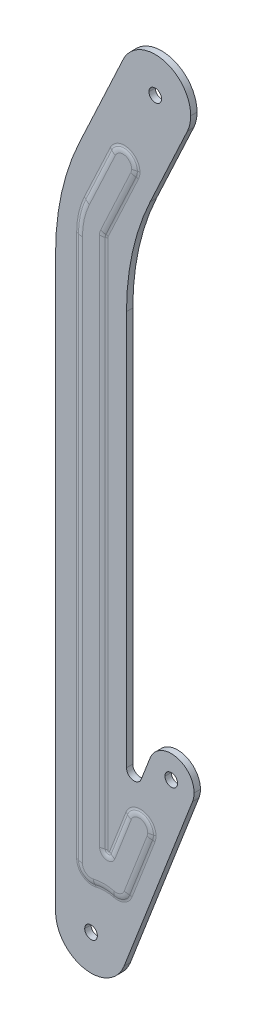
ISO-10303-21;
HEADER;
FILE_DESCRIPTION(('STEP AP214'),'2;1');
FILE_NAME('part.step','',(''),(''),'','','');
FILE_SCHEMA(('AUTOMOTIVE_DESIGN { 1 0 10303 214 1 1 1 1 }'));
ENDSEC;
DATA;
#1=APPLICATION_CONTEXT('core data for automotive mechanical design processes');
#2=APPLICATION_PROTOCOL_DEFINITION('international standard','automotive_design',2000,#1);
#3=PRODUCT_CONTEXT('',#1,'mechanical');
#4=PRODUCT('Part','Part','',(#3));
#5=PRODUCT_RELATED_PRODUCT_CATEGORY('part','',(#4));
#6=PRODUCT_DEFINITION_FORMATION('','',#4);
#7=PRODUCT_DEFINITION_CONTEXT('part definition',#1,'design');
#8=PRODUCT_DEFINITION('design','',#6,#7);
#9=PRODUCT_DEFINITION_SHAPE('','',#8);
#10=(LENGTH_UNIT() NAMED_UNIT(*) SI_UNIT(.MILLI.,.METRE.));
#11=(NAMED_UNIT(*) PLANE_ANGLE_UNIT() SI_UNIT($,.RADIAN.));
#12=(NAMED_UNIT(*) SI_UNIT($,.STERADIAN.) SOLID_ANGLE_UNIT());
#13=UNCERTAINTY_MEASURE_WITH_UNIT(LENGTH_MEASURE(1.E-05),#10,'distance_accuracy_value','');
#14=(GEOMETRIC_REPRESENTATION_CONTEXT(3) GLOBAL_UNCERTAINTY_ASSIGNED_CONTEXT((#13)) GLOBAL_UNIT_ASSIGNED_CONTEXT((#10,
#11,#12)) REPRESENTATION_CONTEXT('',''));
#15=CARTESIAN_POINT('',(0.,0.,0.));
#16=DIRECTION('',(0.,0.,1.));
#17=DIRECTION('',(1.,0.,0.));
#18=AXIS2_PLACEMENT_3D('',#15,#16,#17);
#19=CARTESIAN_POINT('',(26.4837611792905,236.641321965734,0.500000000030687));
#20=DIRECTION('',(0.,0.,1.));
#21=DIRECTION('',(1.,0.,0.));
#22=AXIS2_PLACEMENT_3D('',#19,#20,#21);
#23=PLANE('',#22);
#24=CARTESIAN_POINT('',(13.1623090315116,269.59461680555,0.500000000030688));
#25=DIRECTION('',(0.,0.,1.));
#26=DIRECTION('',(-1.,0.,0.));
#27=AXIS2_PLACEMENT_3D('',#24,#25,#26);
#28=CIRCLE('',#27,3.36936340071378);
#29=CARTESIAN_POINT('',(16.2159893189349,268.170662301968,0.500000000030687));
#30=VERTEX_POINT('',#29);
#31=CARTESIAN_POINT('',(16.5316724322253,269.59461680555,0.500000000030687));
#32=VERTEX_POINT('',#31);
#33=EDGE_CURVE('E1110',#30,#32,#28,.T.);
#34=ORIENTED_EDGE('',*,*,#33,.T.);
#35=CARTESIAN_POINT('',(13.1623090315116,269.59461680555,0.500000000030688));
#36=DIRECTION('',(0.,0.,1.));
#37=DIRECTION('',(-1.,0.,0.));
#38=AXIS2_PLACEMENT_3D('',#35,#36,#37);
#39=CIRCLE('',#38,3.36936340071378);
#40=CARTESIAN_POINT('',(10.1086287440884,271.018571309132,0.500000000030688));
#41=VERTEX_POINT('',#40);
#42=EDGE_CURVE('E713',#32,#41,#39,.T.);
#43=ORIENTED_EDGE('',*,*,#42,.T.);
#44=DIRECTION('',(-0.422618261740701,-0.906307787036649,0.));
#45=VECTOR('',#44,1.);
#46=CARTESIAN_POINT('',(-0.133921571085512,249.053351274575,0.50000000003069));
#47=LINE('',#46,#45);
#48=CARTESIAN_POINT('',(-0.133921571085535,249.053351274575,0.50000000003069));
#49=VERTEX_POINT('',#48);
#50=EDGE_CURVE('E1124',#41,#49,#47,.T.);
#51=ORIENTED_EDGE('',*,*,#50,.T.);
#52=CARTESIAN_POINT('',(26.4837611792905,236.641321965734,0.500000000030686));
#53=DIRECTION('',(0.,0.,1.));
#54=DIRECTION('',(-1.,0.,0.));
#55=AXIS2_PLACEMENT_3D('',#52,#53,#54);
#56=CIRCLE('',#55,29.3693634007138);
#57=CARTESIAN_POINT('',(-2.88560222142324,236.641321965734,0.50000000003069));
#58=VERTEX_POINT('',#57);
#59=EDGE_CURVE('E1088',#49,#58,#56,.T.);
#60=ORIENTED_EDGE('',*,*,#59,.T.);
#61=DIRECTION('',(0.,-1.,0.));
#62=VECTOR('',#61,1.);
#63=CARTESIAN_POINT('',(-2.88560222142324,236.641321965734,0.50000000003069));
#64=LINE('',#63,#62);
#65=CARTESIAN_POINT('',(-2.88560222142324,22.4053831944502,0.50000000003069));
#66=VERTEX_POINT('',#65);
#67=EDGE_CURVE('E886',#58,#66,#64,.T.);
#68=ORIENTED_EDGE('',*,*,#67,.T.);
#69=CARTESIAN_POINT('',(0.483761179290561,22.4053831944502,0.50000000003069));
#70=DIRECTION('',(0.,0.,1.));
#71=DIRECTION('',(-1.,0.,0.));
#72=AXIS2_PLACEMENT_3D('',#69,#70,#71);
#73=CIRCLE('',#72,3.3693634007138);
#74=CARTESIAN_POINT('',(1.30095183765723,19.1366205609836,0.50000000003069));
#75=VERTEX_POINT('',#74);
#76=EDGE_CURVE('E1174',#66,#75,#73,.T.);
#77=ORIENTED_EDGE('',*,*,#76,.T.);
#78=CARTESIAN_POINT('',(5.48376117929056,2.40538319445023,0.500000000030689));
#79=DIRECTION('',(0.,0.,-1.));
#80=DIRECTION('',(1.,0.,0.));
#81=AXIS2_PLACEMENT_3D('',#78,#79,#80);
#82=CIRCLE('',#81,17.2461647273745);
#83=CARTESIAN_POINT('',(9.6665705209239,19.1366205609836,0.500000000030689));
#84=VERTEX_POINT('',#83);
#85=EDGE_CURVE('E653',#75,#84,#82,.T.);
#86=ORIENTED_EDGE('',*,*,#85,.T.);
#87=CARTESIAN_POINT('',(10.4837611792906,22.4053831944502,0.500000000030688));
#88=DIRECTION('',(0.,0.,1.));
#89=DIRECTION('',(-1.,0.,0.));
#90=AXIS2_PLACEMENT_3D('',#87,#88,#89);
#91=CIRCLE('',#90,3.36936340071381);
#92=CARTESIAN_POINT('',(13.625523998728,21.1880352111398,0.500000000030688));
#93=VERTEX_POINT('',#92);
#94=EDGE_CURVE('E907',#84,#93,#91,.T.);
#95=ORIENTED_EDGE('',*,*,#94,.T.);
#96=DIRECTION('',(0.361299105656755,0.932449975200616,0.));
#97=VECTOR('',#96,1.);
#98=CARTESIAN_POINT('',(13.625523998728,21.1880352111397,0.500000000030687));
#99=LINE('',#98,#97);
#100=CARTESIAN_POINT('',(22.6580016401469,44.4992845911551,0.500000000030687));
#101=VERTEX_POINT('',#100);
#102=EDGE_CURVE('E636',#93,#101,#99,.T.);
#103=ORIENTED_EDGE('',*,*,#102,.T.);
#104=CARTESIAN_POINT('',(19.5162388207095,45.7166325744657,0.500000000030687));
#105=DIRECTION('',(0.,0.,1.));
#106=DIRECTION('',(-1.,0.,0.));
#107=AXIS2_PLACEMENT_3D('',#104,#105,#106);
#108=CIRCLE('',#107,3.3693634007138);
#109=CARTESIAN_POINT('',(22.8856022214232,45.7166325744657,0.500000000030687));
#110=VERTEX_POINT('',#109);
#111=EDGE_CURVE('E39',#101,#110,#108,.T.);
#112=ORIENTED_EDGE('',*,*,#111,.T.);
#113=CARTESIAN_POINT('',(19.5162388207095,45.7166325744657,0.500000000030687));
#114=DIRECTION('',(0.,0.,1.));
#115=DIRECTION('',(-1.,0.,0.));
#116=AXIS2_PLACEMENT_3D('',#113,#114,#115);
#117=CIRCLE('',#116,3.3693634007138);
#118=CARTESIAN_POINT('',(16.374476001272,46.9339805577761,0.500000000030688));
#119=VERTEX_POINT('',#118);
#120=EDGE_CURVE('E859',#110,#119,#117,.T.);
#121=ORIENTED_EDGE('',*,*,#120,.T.);
#122=DIRECTION('',(-0.361299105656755,-0.932449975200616,0.));
#123=VECTOR('',#122,1.);
#124=CARTESIAN_POINT('',(9.90292319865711,30.232031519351,0.500000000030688));
#125=LINE('',#124,#123);
#126=CARTESIAN_POINT('',(9.90292319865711,30.232031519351,0.500000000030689));
#127=VERTEX_POINT('',#126);
#128=EDGE_CURVE('E722',#119,#127,#125,.T.);
#129=ORIENTED_EDGE('',*,*,#128,.T.);
#130=CARTESIAN_POINT('',(6.98376117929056,31.3631277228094,0.500000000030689));
#131=DIRECTION('',(0.,0.,-1.));
#132=DIRECTION('',(1.,0.,0.));
#133=AXIS2_PLACEMENT_3D('',#130,#131,#132);
#134=CIRCLE('',#133,3.1306365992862);
#135=CARTESIAN_POINT('',(3.85312458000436,31.3631277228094,0.500000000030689));
#136=VERTEX_POINT('',#135);
#137=EDGE_CURVE('E796',#127,#136,#134,.T.);
#138=ORIENTED_EDGE('',*,*,#137,.T.);
#139=DIRECTION('',(0.,1.,0.));
#140=VECTOR('',#139,1.);
#141=CARTESIAN_POINT('',(3.85312458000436,236.641321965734,0.500000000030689));
#142=LINE('',#141,#140);
#143=CARTESIAN_POINT('',(3.85312458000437,240.631825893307,0.500000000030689));
#144=VERTEX_POINT('',#143);
#145=EDGE_CURVE('E654',#136,#144,#142,.T.);
#146=ORIENTED_EDGE('',*,*,#145,.T.);
#147=CARTESIAN_POINT('',(8.48376117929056,240.631825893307,0.500000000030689));
#148=DIRECTION('',(0.,0.,-1.));
#149=DIRECTION('',(1.,0.,0.));
#150=AXIS2_PLACEMENT_3D('',#147,#148,#149);
#151=CIRCLE('',#150,4.63063659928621);
#152=CARTESIAN_POINT('',(4.28697917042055,242.58881748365,0.500000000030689));
#153=VERTEX_POINT('',#152);
#154=EDGE_CURVE('E783',#144,#153,#151,.T.);
#155=ORIENTED_EDGE('',*,*,#154,.T.);
#156=DIRECTION('',(0.422618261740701,0.906307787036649,0.));
#157=VECTOR('',#156,1.);
#158=CARTESIAN_POINT('',(4.28697917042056,242.58881748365,0.50000000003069));
#159=LINE('',#158,#157);
#160=EDGE_CURVE('E965',#153,#30,#159,.T.);
#161=ORIENTED_EDGE('',*,*,#160,.T.);
#162=EDGE_LOOP('',(#34,#43,#51,#60,#68,#77,#86,#95,#103,#112,#121,#129,#138,#146,#155,#161));
#163=FACE_BOUND('',#162,.T.);
#164=ADVANCED_FACE('F15',(#163),#23,.T.);
#165=CARTESIAN_POINT('',(0.483761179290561,22.4053831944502,2.5000000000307));
#166=DIRECTION('',(0.,0.,1.));
#167=DIRECTION('',(1.,0.,0.));
#168=AXIS2_PLACEMENT_3D('',#165,#166,#167);
#169=TOROIDAL_SURFACE('',#168,6.15324558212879,2.5);
#170=CARTESIAN_POINT('',(1.97614244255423,16.4358581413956,2.5000000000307));
#171=DIRECTION('',(-0.970142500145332,-0.242535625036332,0.));
#172=DIRECTION('',(0.242535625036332,-0.970142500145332,0.));
#173=AXIS2_PLACEMENT_3D('',#170,#171,#172);
#174=CIRCLE('',#173,2.5);
#175=CARTESIAN_POINT('',(1.76514537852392,17.2798463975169,0.156250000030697));
#176=VERTEX_POINT('',#175);
#177=CARTESIAN_POINT('',(1.97614244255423,16.4358581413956,3.06985298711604E-11));
#178=VERTEX_POINT('',#177);
#179=EDGE_CURVE('E9',#176,#178,#174,.T.);
#180=ORIENTED_EDGE('',*,*,#179,.F.);
#181=CARTESIAN_POINT('',(0.483761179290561,22.4053831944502,0.156250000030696));
#182=DIRECTION('',(0.,0.,-1.));
#183=DIRECTION('',(1.,0.,0.));
#184=AXIS2_PLACEMENT_3D('',#181,#182,#183);
#185=CIRCLE('',#184,5.28328240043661);
#186=CARTESIAN_POINT('',(-4.79952122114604,22.4053831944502,0.156250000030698));
#187=VERTEX_POINT('',#186);
#188=EDGE_CURVE('E869',#176,#187,#185,.T.);
#189=ORIENTED_EDGE('',*,*,#188,.T.);
#190=CARTESIAN_POINT('',(-5.66948440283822,22.4053831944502,2.5000000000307));
#191=DIRECTION('',(0.,-1.,0.));
#192=DIRECTION('',(0.,0.,1.));
#193=AXIS2_PLACEMENT_3D('',#190,#191,#192);
#194=CIRCLE('',#193,2.5);
#195=CARTESIAN_POINT('',(-5.66948440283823,22.4053831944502,1.53498606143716E-11));
#196=VERTEX_POINT('',#195);
#197=EDGE_CURVE('E25',#196,#187,#194,.T.);
#198=ORIENTED_EDGE('',*,*,#197,.F.);
#199=CARTESIAN_POINT('',(0.483761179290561,22.4053831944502,3.06989676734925E-11));
#200=DIRECTION('',(0.,0.,-1.));
#201=DIRECTION('',(1.,0.,0.));
#202=AXIS2_PLACEMENT_3D('',#199,#200,#201);
#203=CIRCLE('',#202,6.15324558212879);
#204=EDGE_CURVE('E823',#178,#196,#203,.T.);
#205=ORIENTED_EDGE('',*,*,#204,.F.);
#206=EDGE_LOOP('',(#180,#189,#198,#205));
#207=FACE_BOUND('',#206,.T.);
#208=ADVANCED_FACE('F2451',(#207),#169,.F.);
#209=CARTESIAN_POINT('',(5.48376117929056,2.40538319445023,2.5000000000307));
#210=DIRECTION('',(0.,0.,-1.));
#211=DIRECTION('',(-1.,0.,0.));
#212=AXIS2_PLACEMENT_3D('',#209,#210,#211);
#213=TOROIDAL_SURFACE('',#212,14.4622825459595,2.5);
#214=CARTESIAN_POINT('',(8.9913799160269,16.4358581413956,2.5000000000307));
#215=DIRECTION('',(-0.970142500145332,0.242535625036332,0.));
#216=DIRECTION('',(-0.242535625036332,-0.970142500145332,0.));
#217=AXIS2_PLACEMENT_3D('',#214,#215,#216);
#218=CIRCLE('',#217,2.5);
#219=CARTESIAN_POINT('',(9.20237698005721,17.2798463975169,0.156250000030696));
#220=VERTEX_POINT('',#219);
#221=CARTESIAN_POINT('',(8.9913799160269,16.4358581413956,1.53481848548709E-11));
#222=VERTEX_POINT('',#221);
#223=EDGE_CURVE('E748',#220,#222,#218,.T.);
#224=ORIENTED_EDGE('',*,*,#223,.F.);
#225=CARTESIAN_POINT('',(5.48376117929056,2.40538319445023,0.156250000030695));
#226=DIRECTION('',(0.,0.,1.));
#227=DIRECTION('',(-1.,0.,0.));
#228=AXIS2_PLACEMENT_3D('',#225,#226,#227);
#229=CIRCLE('',#228,15.3322457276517);
#230=EDGE_CURVE('E937',#220,#176,#229,.T.);
#231=ORIENTED_EDGE('',*,*,#230,.T.);
#232=ORIENTED_EDGE('',*,*,#179,.T.);
#233=CARTESIAN_POINT('',(5.48376117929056,2.40538319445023,3.06981003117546E-11));
#234=DIRECTION('',(0.,0.,1.));
#235=DIRECTION('',(-1.,0.,0.));
#236=AXIS2_PLACEMENT_3D('',#233,#234,#235);
#237=CIRCLE('',#236,14.4622825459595);
#238=EDGE_CURVE('E994',#222,#178,#237,.T.);
#239=ORIENTED_EDGE('',*,*,#238,.F.);
#240=EDGE_LOOP('',(#224,#231,#232,#239));
#241=FACE_BOUND('',#240,.T.);
#242=ADVANCED_FACE('F2456',(#241),#213,.F.);
#243=CARTESIAN_POINT('',(-5.66948440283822,22.4053831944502,2.5000000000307));
#244=DIRECTION('',(0.,1.,0.));
#245=DIRECTION('',(1.,0.,0.));
#246=AXIS2_PLACEMENT_3D('',#243,#244,#245);
#247=CYLINDRICAL_SURFACE('',#246,2.5);
#248=ORIENTED_EDGE('',*,*,#197,.T.);
#249=DIRECTION('',(0.,1.,0.));
#250=VECTOR('',#249,1.);
#251=CARTESIAN_POINT('',(-4.79952122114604,22.4053831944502,0.156250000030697));
#252=LINE('',#251,#250);
#253=CARTESIAN_POINT('',(-4.79952122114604,236.641321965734,0.156250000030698));
#254=VERTEX_POINT('',#253);
#255=EDGE_CURVE('E890',#187,#254,#252,.T.);
#256=ORIENTED_EDGE('',*,*,#255,.T.);
#257=CARTESIAN_POINT('',(-5.66948440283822,236.641321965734,2.5000000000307));
#258=DIRECTION('',(0.,-1.,0.));
#259=DIRECTION('',(-1.,0.,0.));
#260=AXIS2_PLACEMENT_3D('',#257,#258,#259);
#261=CIRCLE('',#260,2.5);
#262=CARTESIAN_POINT('',(-5.66948440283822,236.641321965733,1.53497006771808E-11));
#263=VERTEX_POINT('',#262);
#264=EDGE_CURVE('E702',#263,#254,#261,.T.);
#265=ORIENTED_EDGE('',*,*,#264,.F.);
#266=DIRECTION('',(0.,1.,0.));
#267=VECTOR('',#266,1.);
#268=CARTESIAN_POINT('',(-5.66948440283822,22.4053831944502,3.06994013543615E-11));
#269=LINE('',#268,#267);
#270=EDGE_CURVE('E818',#196,#263,#269,.T.);
#271=ORIENTED_EDGE('',*,*,#270,.F.);
#272=EDGE_LOOP('',(#248,#256,#265,#271));
#273=FACE_BOUND('',#272,.T.);
#274=ADVANCED_FACE('F2558',(#273),#247,.F.);
#275=CARTESIAN_POINT('',(10.4837611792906,22.4053831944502,2.5000000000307));
#276=DIRECTION('',(0.,0.,1.));
#277=DIRECTION('',(1.,0.,0.));
#278=AXIS2_PLACEMENT_3D('',#275,#276,#277);
#279=TOROIDAL_SURFACE('',#278,6.1532455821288,2.5);
#280=CARTESIAN_POINT('',(16.2213548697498,20.1822210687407,2.5000000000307));
#281=DIRECTION('',(-0.361299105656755,-0.932449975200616,0.));
#282=DIRECTION('',(0.932449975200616,-0.361299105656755,0.));
#283=AXIS2_PLACEMENT_3D('',#280,#281,#282);
#284=CIRCLE('',#283,2.5);
#285=CARTESIAN_POINT('',(15.4101577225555,20.4965379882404,0.156250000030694));
#286=VERTEX_POINT('',#285);
#287=CARTESIAN_POINT('',(16.2213548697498,20.1822210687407,1.53484819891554E-11));
#288=VERTEX_POINT('',#287);
#289=EDGE_CURVE('E699',#286,#288,#284,.T.);
#290=ORIENTED_EDGE('',*,*,#289,.F.);
#291=CARTESIAN_POINT('',(10.4837611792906,22.4053831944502,0.156250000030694));
#292=DIRECTION('',(0.,0.,-1.));
#293=DIRECTION('',(1.,0.,0.));
#294=AXIS2_PLACEMENT_3D('',#291,#292,#293);
#295=CIRCLE('',#294,5.28328240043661);
#296=EDGE_CURVE('E723',#286,#220,#295,.T.);
#297=ORIENTED_EDGE('',*,*,#296,.T.);
#298=ORIENTED_EDGE('',*,*,#223,.T.);
#299=CARTESIAN_POINT('',(10.4837611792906,22.4053831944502,3.06972329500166E-11));
#300=DIRECTION('',(0.,0.,-1.));
#301=DIRECTION('',(1.,0.,0.));
#302=AXIS2_PLACEMENT_3D('',#299,#300,#301);
#303=CIRCLE('',#302,6.1532455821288);
#304=EDGE_CURVE('E932',#288,#222,#303,.T.);
#305=ORIENTED_EDGE('',*,*,#304,.F.);
#306=EDGE_LOOP('',(#290,#297,#298,#305));
#307=FACE_BOUND('',#306,.T.);
#308=ADVANCED_FACE('F2554',(#307),#279,.F.);
#309=CARTESIAN_POINT('',(26.4837611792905,236.641321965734,2.5000000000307));
#310=DIRECTION('',(0.,0.,1.));
#311=DIRECTION('',(1.,0.,0.));
#312=AXIS2_PLACEMENT_3D('',#309,#310,#311);
#313=TOROIDAL_SURFACE('',#312,32.1532455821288,2.5);
#314=ORIENTED_EDGE('',*,*,#264,.T.);
#315=CARTESIAN_POINT('',(26.4837611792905,236.641321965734,0.156250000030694));
#316=DIRECTION('',(0.,0.,-1.));
#317=DIRECTION('',(1.,0.,0.));
#318=AXIS2_PLACEMENT_3D('',#315,#316,#317);
#319=CIRCLE('',#318,31.2832824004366);
#320=CARTESIAN_POINT('',(-1.8685212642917,249.86220839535,0.156250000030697));
#321=VERTEX_POINT('',#320);
#322=EDGE_CURVE('E1139',#254,#321,#319,.T.);
#323=ORIENTED_EDGE('',*,*,#322,.T.);
#324=CARTESIAN_POINT('',(-2.6569756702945,250.229870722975,2.5000000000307));
#325=DIRECTION('',(-0.422618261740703,-0.906307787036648,0.));
#326=DIRECTION('',(-0.906307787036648,0.422618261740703,0.));
#327=AXIS2_PLACEMENT_3D('',#324,#325,#326);
#328=CIRCLE('',#327,2.5);
#329=CARTESIAN_POINT('',(-2.6569756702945,250.229870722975,1.53510513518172E-11));
#330=VERTEX_POINT('',#329);
#331=EDGE_CURVE('E631',#330,#321,#328,.T.);
#332=ORIENTED_EDGE('',*,*,#331,.F.);
#333=CARTESIAN_POINT('',(26.4837611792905,236.641321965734,3.06954982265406E-11));
#334=DIRECTION('',(0.,0.,-1.));
#335=DIRECTION('',(1.,0.,0.));
#336=AXIS2_PLACEMENT_3D('',#333,#334,#335);
#337=CIRCLE('',#336,32.1532455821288);
#338=EDGE_CURVE('E822',#263,#330,#337,.T.);
#339=ORIENTED_EDGE('',*,*,#338,.F.);
#340=EDGE_LOOP('',(#314,#323,#332,#339));
#341=FACE_BOUND('',#340,.T.);
#342=ADVANCED_FACE('F2557',(#341),#313,.F.);
#343=CARTESIAN_POINT('',(16.2213548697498,20.1822210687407,2.5000000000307));
#344=DIRECTION('',(-0.361299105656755,-0.932449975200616,0.));
#345=DIRECTION('',(-0.932449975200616,0.361299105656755,0.));
#346=AXIS2_PLACEMENT_3D('',#343,#344,#345);
#347=CYLINDRICAL_SURFACE('',#346,2.5);
#348=CARTESIAN_POINT('',(25.2538325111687,43.4934704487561,2.5000000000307));
#349=DIRECTION('',(-0.361299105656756,-0.932449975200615,0.));
#350=DIRECTION('',(0.932449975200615,-0.361299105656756,0.));
#351=AXIS2_PLACEMENT_3D('',#348,#349,#350);
#352=CIRCLE('',#351,2.5);
#353=CARTESIAN_POINT('',(24.4426353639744,43.8077873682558,0.156250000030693));
#354=VERTEX_POINT('',#353);
#355=CARTESIAN_POINT('',(25.2538325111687,43.4934704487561,1.53475322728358E-11));
#356=VERTEX_POINT('',#355);
#357=EDGE_CURVE('E53',#354,#356,#352,.T.);
#358=ORIENTED_EDGE('',*,*,#357,.F.);
#359=DIRECTION('',(-0.361299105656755,-0.932449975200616,0.));
#360=VECTOR('',#359,1.);
#361=CARTESIAN_POINT('',(15.4101577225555,20.4965379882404,0.156250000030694));
#362=LINE('',#361,#360);
#363=EDGE_CURVE('E633',#354,#286,#362,.T.);
#364=ORIENTED_EDGE('',*,*,#363,.T.);
#365=ORIENTED_EDGE('',*,*,#289,.T.);
#366=DIRECTION('',(-0.361299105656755,-0.932449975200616,0.));
#367=VECTOR('',#366,1.);
#368=CARTESIAN_POINT('',(16.2213548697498,20.1822210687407,3.06976666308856E-11));
#369=LINE('',#368,#367);
#370=EDGE_CURVE('E928',#356,#288,#369,.T.);
#371=ORIENTED_EDGE('',*,*,#370,.F.);
#372=EDGE_LOOP('',(#358,#364,#365,#371));
#373=FACE_BOUND('',#372,.T.);
#374=ADVANCED_FACE('F2601',(#373),#347,.F.);
#375=CARTESIAN_POINT('',(-2.6569756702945,250.229870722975,2.5000000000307));
#376=DIRECTION('',(0.422618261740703,0.906307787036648,0.));
#377=DIRECTION('',(0.906307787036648,-0.422618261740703,0.));
#378=AXIS2_PLACEMENT_3D('',#375,#376,#377);
#379=CYLINDRICAL_SURFACE('',#378,2.5);
#380=ORIENTED_EDGE('',*,*,#331,.T.);
#381=DIRECTION('',(0.422618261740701,0.906307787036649,0.));
#382=VECTOR('',#381,1.);
#383=CARTESIAN_POINT('',(-1.8685212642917,249.86220839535,0.156250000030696));
#384=LINE('',#383,#382);
#385=CARTESIAN_POINT('',(8.37402905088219,271.827428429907,0.156250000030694));
#386=VERTEX_POINT('',#385);
#387=EDGE_CURVE('E1114',#321,#386,#384,.T.);
#388=ORIENTED_EDGE('',*,*,#387,.T.);
#389=CARTESIAN_POINT('',(7.58557464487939,272.195090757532,2.5000000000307));
#390=DIRECTION('',(-0.422618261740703,-0.906307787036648,0.));
#391=DIRECTION('',(-0.906307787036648,0.422618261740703,0.));
#392=AXIS2_PLACEMENT_3D('',#389,#390,#391);
#393=CIRCLE('',#392,2.5);
#394=CARTESIAN_POINT('',(7.5855746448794,272.195090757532,1.53483996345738E-11));
#395=VERTEX_POINT('',#394);
#396=EDGE_CURVE('E665',#395,#386,#393,.T.);
#397=ORIENTED_EDGE('',*,*,#396,.F.);
#398=DIRECTION('',(0.422618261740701,0.906307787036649,0.));
#399=VECTOR('',#398,1.);
#400=CARTESIAN_POINT('',(-2.6569756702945,250.229870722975,3.06989676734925E-11));
#401=LINE('',#400,#399);
#402=EDGE_CURVE('E712',#330,#395,#401,.T.);
#403=ORIENTED_EDGE('',*,*,#402,.F.);
#404=EDGE_LOOP('',(#380,#388,#397,#403));
#405=FACE_BOUND('',#404,.T.);
#406=ADVANCED_FACE('F2604',(#405),#379,.F.);
#407=CARTESIAN_POINT('',(19.5162388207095,45.7166325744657,2.5000000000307));
#408=DIRECTION('',(0.,0.,1.));
#409=DIRECTION('',(1.,0.,0.));
#410=AXIS2_PLACEMENT_3D('',#407,#408,#409);
#411=TOROIDAL_SURFACE('',#410,6.15324558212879,2.5);
#412=CARTESIAN_POINT('',(25.6694844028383,45.7166325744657,2.5000000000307));
#413=DIRECTION('',(0.,-1.,0.));
#414=DIRECTION('',(0.,0.,-1.));
#415=AXIS2_PLACEMENT_3D('',#412,#413,#414);
#416=CIRCLE('',#415,2.5);
#417=CARTESIAN_POINT('',(24.7995212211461,45.7166325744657,0.156250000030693));
#418=VERTEX_POINT('',#417);
#419=CARTESIAN_POINT('',(25.6694844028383,45.7166325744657,3.06955551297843E-11));
#420=VERTEX_POINT('',#419);
#421=EDGE_CURVE('E920',#418,#420,#416,.T.);
#422=ORIENTED_EDGE('',*,*,#421,.F.);
#423=CARTESIAN_POINT('',(19.5162388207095,45.7166325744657,0.156250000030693));
#424=DIRECTION('',(0.,0.,-1.));
#425=DIRECTION('',(1.,0.,0.));
#426=AXIS2_PLACEMENT_3D('',#423,#424,#425);
#427=CIRCLE('',#426,5.28328240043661);
#428=EDGE_CURVE('E801',#418,#354,#427,.T.);
#429=ORIENTED_EDGE('',*,*,#428,.T.);
#430=ORIENTED_EDGE('',*,*,#357,.T.);
#431=CARTESIAN_POINT('',(19.5162388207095,45.7166325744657,3.06963655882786E-11));
#432=DIRECTION('',(0.,0.,-1.));
#433=DIRECTION('',(1.,0.,0.));
#434=AXIS2_PLACEMENT_3D('',#431,#432,#433);
#435=CIRCLE('',#434,6.15324558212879);
#436=EDGE_CURVE('E933',#420,#356,#435,.T.);
#437=ORIENTED_EDGE('',*,*,#436,.F.);
#438=EDGE_LOOP('',(#422,#429,#430,#437));
#439=FACE_BOUND('',#438,.T.);
#440=ADVANCED_FACE('F2787',(#439),#411,.F.);
#441=CARTESIAN_POINT('',(13.1623090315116,269.59461680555,2.5000000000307));
#442=DIRECTION('',(0.,0.,1.));
#443=DIRECTION('',(1.,0.,0.));
#444=AXIS2_PLACEMENT_3D('',#441,#442,#443);
#445=TOROIDAL_SURFACE('',#444,6.1532455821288,2.5);
#446=CARTESIAN_POINT('',(19.3155546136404,269.59461680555,2.5000000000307));
#447=DIRECTION('',(0.,-1.,0.));
#448=DIRECTION('',(0.,0.,-1.));
#449=AXIS2_PLACEMENT_3D('',#446,#447,#448);
#450=CIRCLE('',#449,2.5);
#451=CARTESIAN_POINT('',(18.4455914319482,269.59461680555,0.156250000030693));
#452=VERTEX_POINT('',#451);
#453=CARTESIAN_POINT('',(19.3155546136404,269.59461680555,3.06964224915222E-11));
#454=VERTEX_POINT('',#453);
#455=EDGE_CURVE('E659',#452,#454,#450,.T.);
#456=ORIENTED_EDGE('',*,*,#455,.F.);
#457=CARTESIAN_POINT('',(13.1623090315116,269.59461680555,0.156250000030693));
#458=DIRECTION('',(0.,0.,-1.));
#459=DIRECTION('',(1.,0.,0.));
#460=AXIS2_PLACEMENT_3D('',#457,#458,#459);
#461=CIRCLE('',#460,5.28328240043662);
#462=CARTESIAN_POINT('',(17.950589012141,267.361805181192,0.156250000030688));
#463=VERTEX_POINT('',#462);
#464=EDGE_CURVE('E1089',#452,#463,#461,.T.);
#465=ORIENTED_EDGE('',*,*,#464,.T.);
#466=CARTESIAN_POINT('',(18.7390434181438,266.994142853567,2.5000000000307));
#467=DIRECTION('',(0.422618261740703,0.906307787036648,0.));
#468=DIRECTION('',(0.906307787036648,-0.422618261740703,0.));
#469=AXIS2_PLACEMENT_3D('',#466,#467,#468);
#470=CIRCLE('',#469,2.5);
#471=CARTESIAN_POINT('',(18.7390434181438,266.994142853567,1.5348058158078E-11));
#472=VERTEX_POINT('',#471);
#473=EDGE_CURVE('E632',#472,#463,#470,.T.);
#474=ORIENTED_EDGE('',*,*,#473,.F.);
#475=CARTESIAN_POINT('',(13.1623090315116,269.59461680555,3.06972329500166E-11));
#476=DIRECTION('',(0.,0.,-1.));
#477=DIRECTION('',(1.,0.,0.));
#478=AXIS2_PLACEMENT_3D('',#475,#476,#477);
#479=CIRCLE('',#478,6.1532455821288);
#480=EDGE_CURVE('E707',#454,#472,#479,.T.);
#481=ORIENTED_EDGE('',*,*,#480,.F.);
#482=EDGE_LOOP('',(#456,#465,#474,#481));
#483=FACE_BOUND('',#482,.T.);
#484=ADVANCED_FACE('F1209',(#483),#445,.F.);
#485=CARTESIAN_POINT('',(7.30709232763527,31.23784566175,2.5000000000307));
#486=DIRECTION('',(0.361299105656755,0.932449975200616,0.));
#487=DIRECTION('',(0.932449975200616,-0.361299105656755,0.));
#488=AXIS2_PLACEMENT_3D('',#485,#486,#487);
#489=CYLINDRICAL_SURFACE('',#488,2.5);
#490=CARTESIAN_POINT('',(7.30709232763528,31.23784566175,2.5000000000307));
#491=DIRECTION('',(0.361299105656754,0.932449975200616,0.));
#492=DIRECTION('',(-0.932449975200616,0.361299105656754,0.));
#493=AXIS2_PLACEMENT_3D('',#490,#491,#492);
#494=CIRCLE('',#493,2.5);
#495=CARTESIAN_POINT('',(8.1182894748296,30.9235287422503,0.156250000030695));
#496=VERTEX_POINT('',#495);
#497=CARTESIAN_POINT('',(7.30709232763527,31.23784566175,1.53488333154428E-11));
#498=VERTEX_POINT('',#497);
#499=EDGE_CURVE('E189',#496,#498,#494,.T.);
#500=ORIENTED_EDGE('',*,*,#499,.F.);
#501=DIRECTION('',(0.361299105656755,0.932449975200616,0.));
#502=VECTOR('',#501,1.);
#503=CARTESIAN_POINT('',(8.1182894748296,30.9235287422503,0.156250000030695));
#504=LINE('',#503,#502);
#505=CARTESIAN_POINT('',(14.5898422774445,47.6254777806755,0.156250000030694));
#506=VERTEX_POINT('',#505);
#507=EDGE_CURVE('E719',#496,#506,#504,.T.);
#508=ORIENTED_EDGE('',*,*,#507,.T.);
#509=CARTESIAN_POINT('',(13.7786451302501,47.9397947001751,2.5000000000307));
#510=DIRECTION('',(0.361299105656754,0.932449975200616,0.));
#511=DIRECTION('',(-0.932449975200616,0.361299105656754,0.));
#512=AXIS2_PLACEMENT_3D('',#509,#510,#511);
#513=CIRCLE('',#512,2.5);
#514=CARTESIAN_POINT('',(13.7786451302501,47.9397947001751,1.53483172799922E-11));
#515=VERTEX_POINT('',#514);
#516=EDGE_CURVE('E660',#506,#515,#513,.T.);
#517=ORIENTED_EDGE('',*,*,#516,.T.);
#518=DIRECTION('',(0.361299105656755,0.932449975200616,0.));
#519=VECTOR('',#518,1.);
#520=CARTESIAN_POINT('',(7.30709232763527,31.23784566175,3.06972329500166E-11));
#521=LINE('',#520,#519);
#522=EDGE_CURVE('E1007',#498,#515,#521,.T.);
#523=ORIENTED_EDGE('',*,*,#522,.F.);
#524=EDGE_LOOP('',(#500,#508,#517,#523));
#525=FACE_BOUND('',#524,.T.);
#526=ADVANCED_FACE('F2597',(#525),#489,.F.);
#527=CARTESIAN_POINT('',(6.81003326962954,241.41229803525,2.5000000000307));
#528=DIRECTION('',(-0.422618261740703,-0.906307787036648,0.));
#529=DIRECTION('',(-0.906307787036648,0.422618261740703,0.));
#530=AXIS2_PLACEMENT_3D('',#527,#528,#529);
#531=CYLINDRICAL_SURFACE('',#530,2.5);
#532=ORIENTED_EDGE('',*,*,#473,.T.);
#533=DIRECTION('',(-0.422618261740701,-0.906307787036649,0.));
#534=VECTOR('',#533,1.);
#535=CARTESIAN_POINT('',(6.02157886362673,241.779960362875,0.156250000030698));
#536=LINE('',#535,#534);
#537=CARTESIAN_POINT('',(6.02157886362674,241.779960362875,0.156250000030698));
#538=VERTEX_POINT('',#537);
#539=EDGE_CURVE('E1202',#463,#538,#536,.T.);
#540=ORIENTED_EDGE('',*,*,#539,.T.);
#541=CARTESIAN_POINT('',(6.81003326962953,241.41229803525,2.5000000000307));
#542=DIRECTION('',(0.422618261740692,0.906307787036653,0.));
#543=DIRECTION('',(0.906307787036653,-0.422618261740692,0.));
#544=AXIS2_PLACEMENT_3D('',#541,#542,#543);
#545=CIRCLE('',#544,2.5);
#546=CARTESIAN_POINT('',(6.81003326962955,241.41229803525,1.53488333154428E-11));
#547=VERTEX_POINT('',#546);
#548=EDGE_CURVE('E955',#547,#538,#545,.T.);
#549=ORIENTED_EDGE('',*,*,#548,.F.);
#550=DIRECTION('',(-0.422618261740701,-0.906307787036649,0.));
#551=VECTOR('',#550,1.);
#552=CARTESIAN_POINT('',(6.81003326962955,241.41229803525,3.06981003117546E-11));
#553=LINE('',#552,#551);
#554=EDGE_CURVE('E711',#472,#547,#553,.T.);
#555=ORIENTED_EDGE('',*,*,#554,.F.);
#556=EDGE_LOOP('',(#532,#540,#549,#555));
#557=FACE_BOUND('',#556,.T.);
#558=ADVANCED_FACE('F2593',(#557),#531,.F.);
#559=CARTESIAN_POINT('',(6.98376117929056,31.3631277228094,2.5000000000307));
#560=DIRECTION('',(0.,0.,-1.));
#561=DIRECTION('',(-1.,0.,0.));
#562=AXIS2_PLACEMENT_3D('',#559,#560,#561);
#563=DEGENERATE_TOROIDAL_SURFACE('',#562,0.346754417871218,2.5,.T.);
#564=CARTESIAN_POINT('',(6.63700676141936,31.3631277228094,2.5000000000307));
#565=DIRECTION('',(0.,-1.,0.));
#566=DIRECTION('',(1.,0.,0.));
#567=AXIS2_PLACEMENT_3D('',#564,#565,#566);
#568=CIRCLE('',#567,2.5);
#569=CARTESIAN_POINT('',(5.76704357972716,31.3631277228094,0.156250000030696));
#570=VERTEX_POINT('',#569);
#571=CARTESIAN_POINT('',(6.63700676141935,31.3631277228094,0.));
#572=VERTEX_POINT('',#571);
#573=EDGE_CURVE('E1079',#570,#572,#568,.T.);
#574=ORIENTED_EDGE('',*,*,#573,.F.);
#575=CARTESIAN_POINT('',(6.98376117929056,31.3631277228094,0.156250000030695));
#576=DIRECTION('',(0.,0.,1.));
#577=DIRECTION('',(-1.,0.,0.));
#578=AXIS2_PLACEMENT_3D('',#575,#576,#577);
#579=CIRCLE('',#578,1.2167175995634);
#580=EDGE_CURVE('E800',#570,#496,#579,.T.);
#581=ORIENTED_EDGE('',*,*,#580,.T.);
#582=ORIENTED_EDGE('',*,*,#499,.T.);
#583=CARTESIAN_POINT('',(6.98376117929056,31.3631277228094,3.06981003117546E-11));
#584=DIRECTION('',(0.,0.,1.));
#585=DIRECTION('',(-1.,0.,0.));
#586=AXIS2_PLACEMENT_3D('',#583,#584,#585);
#587=CIRCLE('',#586,0.346754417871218);
#588=EDGE_CURVE('E1074',#572,#498,#587,.T.);
#589=ORIENTED_EDGE('',*,*,#588,.F.);
#590=EDGE_LOOP('',(#574,#581,#582,#589));
#591=FACE_BOUND('',#590,.T.);
#592=ADVANCED_FACE('F2596',(#591),#563,.F.);
#593=CARTESIAN_POINT('',(8.48376117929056,240.631825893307,2.5000000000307));
#594=DIRECTION('',(0.,0.,-1.));
#595=DIRECTION('',(-1.,0.,0.));
#596=AXIS2_PLACEMENT_3D('',#593,#594,#595);
#597=DEGENERATE_TOROIDAL_SURFACE('',#596,1.84675441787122,2.5,.T.);
#598=ORIENTED_EDGE('',*,*,#548,.T.);
#599=CARTESIAN_POINT('',(8.48376117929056,240.631825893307,0.156250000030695));
#600=DIRECTION('',(0.,0.,1.));
#601=DIRECTION('',(-1.,2.96280957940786E-13,0.));
#602=AXIS2_PLACEMENT_3D('',#599,#600,#601);
#603=CIRCLE('',#602,2.7167175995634);
#604=CARTESIAN_POINT('',(5.76704357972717,240.631825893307,0.156250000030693));
#605=VERTEX_POINT('',#604);
#606=EDGE_CURVE('E787',#538,#605,#603,.T.);
#607=ORIENTED_EDGE('',*,*,#606,.T.);
#608=CARTESIAN_POINT('',(6.63700676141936,240.631825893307,2.5000000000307));
#609=DIRECTION('',(0.,1.,0.));
#610=DIRECTION('',(1.,0.,0.));
#611=AXIS2_PLACEMENT_3D('',#608,#609,#610);
#612=CIRCLE('',#611,2.5);
#613=CARTESIAN_POINT('',(6.63700676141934,240.631825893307,0.));
#614=VERTEX_POINT('',#613);
#615=EDGE_CURVE('E804',#614,#605,#612,.T.);
#616=ORIENTED_EDGE('',*,*,#615,.F.);
#617=CARTESIAN_POINT('',(8.48376117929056,240.631825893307,3.06981003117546E-11));
#618=DIRECTION('',(0.,0.,1.));
#619=DIRECTION('',(-1.,0.,0.));
#620=AXIS2_PLACEMENT_3D('',#617,#618,#619);
#621=CIRCLE('',#620,1.84675441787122);
#622=EDGE_CURVE('E969',#547,#614,#621,.T.);
#623=ORIENTED_EDGE('',*,*,#622,.F.);
#624=EDGE_LOOP('',(#598,#607,#616,#623));
#625=FACE_BOUND('',#624,.T.);
#626=ADVANCED_FACE('F2485',(#625),#597,.F.);
#627=CARTESIAN_POINT('',(6.63700676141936,31.3631277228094,2.5000000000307));
#628=DIRECTION('',(0.,-1.,0.));
#629=DIRECTION('',(-1.,0.,0.));
#630=AXIS2_PLACEMENT_3D('',#627,#628,#629);
#631=CYLINDRICAL_SURFACE('',#630,2.5);
#632=ORIENTED_EDGE('',*,*,#615,.T.);
#633=DIRECTION('',(0.,-1.,0.));
#634=VECTOR('',#633,1.);
#635=CARTESIAN_POINT('',(5.76704357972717,31.3631277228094,0.156250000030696));
#636=LINE('',#635,#634);
#637=EDGE_CURVE('E795',#605,#570,#636,.T.);
#638=ORIENTED_EDGE('',*,*,#637,.T.);
#639=ORIENTED_EDGE('',*,*,#573,.T.);
#640=DIRECTION('',(0.,-1.,0.));
#641=VECTOR('',#640,1.);
#642=CARTESIAN_POINT('',(6.63700676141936,31.3631277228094,3.06985339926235E-11));
#643=LINE('',#642,#641);
#644=EDGE_CURVE('E1078',#614,#572,#643,.T.);
#645=ORIENTED_EDGE('',*,*,#644,.F.);
#646=EDGE_LOOP('',(#632,#638,#639,#645));
#647=FACE_BOUND('',#646,.T.);
#648=ADVANCED_FACE('F2481',(#647),#631,.F.);
#649=CARTESIAN_POINT('',(19.5162388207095,45.7166325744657,-4.99999999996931));
#650=DIRECTION('',(0.,0.,-1.));
#651=DIRECTION('',(-1.,0.,0.));
#652=AXIS2_PLACEMENT_3D('',#649,#650,#651);
#653=DEGENERATE_TOROIDAL_SURFACE('',#652,3.3693634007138,5.5,.T.);
#654=CARTESIAN_POINT('',(22.8856022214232,45.7166325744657,-4.99999999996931));
#655=DIRECTION('',(0.,1.,0.));
#656=DIRECTION('',(-1.,0.,0.));
#657=AXIS2_PLACEMENT_3D('',#654,#655,#656);
#658=CIRCLE('',#657,5.5);
#659=EDGE_CURVE('E855',#110,#418,#658,.T.);
#660=ORIENTED_EDGE('',*,*,#659,.F.);
#661=ORIENTED_EDGE('',*,*,#111,.F.);
#662=CARTESIAN_POINT('',(22.6580016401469,44.4992845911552,-4.99999999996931));
#663=DIRECTION('',(-0.361299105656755,-0.932449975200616,0.));
#664=DIRECTION('',(0.932449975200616,-0.361299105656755,0.));
#665=AXIS2_PLACEMENT_3D('',#662,#663,#664);
#666=CIRCLE('',#665,5.5);
#667=EDGE_CURVE('E833',#354,#101,#666,.T.);
#668=ORIENTED_EDGE('',*,*,#667,.F.);
#669=ORIENTED_EDGE('',*,*,#428,.F.);
#670=EDGE_LOOP('',(#660,#661,#668,#669));
#671=FACE_BOUND('',#670,.T.);
#672=ADVANCED_FACE('F2484',(#671),#653,.T.);
#673=CARTESIAN_POINT('',(13.625523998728,21.1880352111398,-4.99999999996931));
#674=DIRECTION('',(-0.361299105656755,-0.932449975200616,0.));
#675=DIRECTION('',(-0.932449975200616,0.361299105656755,0.));
#676=AXIS2_PLACEMENT_3D('',#673,#674,#675);
#677=CYLINDRICAL_SURFACE('',#676,5.5);
#678=ORIENTED_EDGE('',*,*,#667,.T.);
#679=ORIENTED_EDGE('',*,*,#102,.F.);
#680=CARTESIAN_POINT('',(13.625523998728,21.1880352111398,-4.99999999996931));
#681=DIRECTION('',(-0.36129910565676,-0.932449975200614,0.));
#682=DIRECTION('',(-0.932449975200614,0.36129910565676,0.));
#683=AXIS2_PLACEMENT_3D('',#680,#681,#682);
#684=CIRCLE('',#683,5.5);
#685=EDGE_CURVE('E799',#286,#93,#684,.T.);
#686=ORIENTED_EDGE('',*,*,#685,.F.);
#687=ORIENTED_EDGE('',*,*,#363,.F.);
#688=EDGE_LOOP('',(#678,#679,#686,#687));
#689=FACE_BOUND('',#688,.T.);
#690=ADVANCED_FACE('F2803',(#689),#677,.T.);
#691=CARTESIAN_POINT('',(9.90292319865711,30.232031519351,-4.99999999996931));
#692=DIRECTION('',(0.361299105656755,0.932449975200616,0.));
#693=DIRECTION('',(0.932449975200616,-0.361299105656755,0.));
#694=AXIS2_PLACEMENT_3D('',#691,#692,#693);
#695=CYLINDRICAL_SURFACE('',#694,5.5);
#696=CARTESIAN_POINT('',(16.374476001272,46.9339805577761,-4.99999999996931));
#697=DIRECTION('',(-0.361299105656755,-0.932449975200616,0.));
#698=DIRECTION('',(-0.932449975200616,0.361299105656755,0.));
#699=AXIS2_PLACEMENT_3D('',#696,#697,#698);
#700=CIRCLE('',#699,5.5);
#701=EDGE_CURVE('E718',#119,#506,#700,.T.);
#702=ORIENTED_EDGE('',*,*,#701,.T.);
#703=ORIENTED_EDGE('',*,*,#507,.F.);
#704=CARTESIAN_POINT('',(9.90292319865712,30.232031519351,-4.99999999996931));
#705=DIRECTION('',(-0.361299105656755,-0.932449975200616,0.));
#706=DIRECTION('',(0.932449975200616,-0.361299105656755,0.));
#707=AXIS2_PLACEMENT_3D('',#704,#705,#706);
#708=CIRCLE('',#707,5.5);
#709=EDGE_CURVE('E1042',#127,#496,#708,.T.);
#710=ORIENTED_EDGE('',*,*,#709,.F.);
#711=ORIENTED_EDGE('',*,*,#128,.F.);
#712=EDGE_LOOP('',(#702,#703,#710,#711));
#713=FACE_BOUND('',#712,.T.);
#714=ADVANCED_FACE('F3186',(#713),#695,.T.);
#715=CARTESIAN_POINT('',(10.4837611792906,22.4053831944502,-4.99999999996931));
#716=DIRECTION('',(0.,0.,-1.));
#717=DIRECTION('',(-1.,0.,0.));
#718=AXIS2_PLACEMENT_3D('',#715,#716,#717);
#719=DEGENERATE_TOROIDAL_SURFACE('',#718,3.36936340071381,5.5,.T.);
#720=ORIENTED_EDGE('',*,*,#685,.T.);
#721=ORIENTED_EDGE('',*,*,#94,.F.);
#722=CARTESIAN_POINT('',(9.6665705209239,19.1366205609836,-4.99999999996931));
#723=DIRECTION('',(-0.970142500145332,0.242535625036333,0.));
#724=DIRECTION('',(0.242535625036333,0.970142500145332,0.));
#725=AXIS2_PLACEMENT_3D('',#722,#723,#724);
#726=CIRCLE('',#725,5.5);
#727=EDGE_CURVE('E649',#220,#84,#726,.T.);
#728=ORIENTED_EDGE('',*,*,#727,.F.);
#729=ORIENTED_EDGE('',*,*,#296,.F.);
#730=EDGE_LOOP('',(#720,#721,#728,#729));
#731=FACE_BOUND('',#730,.T.);
#732=ADVANCED_FACE('F3210',(#731),#719,.T.);
#733=CARTESIAN_POINT('',(6.98376117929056,31.3631277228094,-4.99999999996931));
#734=DIRECTION('',(0.,0.,1.));
#735=DIRECTION('',(1.,0.,0.));
#736=AXIS2_PLACEMENT_3D('',#733,#734,#735);
#737=DEGENERATE_TOROIDAL_SURFACE('',#736,3.13063659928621,5.5,.T.);
#738=ORIENTED_EDGE('',*,*,#709,.T.);
#739=ORIENTED_EDGE('',*,*,#580,.F.);
#740=CARTESIAN_POINT('',(3.85312458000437,31.3631277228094,-4.99999999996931));
#741=DIRECTION('',(0.,1.,0.));
#742=DIRECTION('',(1.,0.,0.));
#743=AXIS2_PLACEMENT_3D('',#740,#741,#742);
#744=CIRCLE('',#743,5.5);
#745=EDGE_CURVE('E865',#136,#570,#744,.T.);
#746=ORIENTED_EDGE('',*,*,#745,.F.);
#747=ORIENTED_EDGE('',*,*,#137,.F.);
#748=EDGE_LOOP('',(#738,#739,#746,#747));
#749=FACE_BOUND('',#748,.T.);
#750=ADVANCED_FACE('F3205',(#749),#737,.T.);
#751=CARTESIAN_POINT('',(5.48376117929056,2.40538319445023,-4.99999999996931));
#752=DIRECTION('',(0.,0.,1.));
#753=DIRECTION('',(1.,0.,0.));
#754=AXIS2_PLACEMENT_3D('',#751,#752,#753);
#755=TOROIDAL_SURFACE('',#754,17.2461647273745,5.5);
#756=ORIENTED_EDGE('',*,*,#727,.T.);
#757=ORIENTED_EDGE('',*,*,#85,.F.);
#758=CARTESIAN_POINT('',(1.30095183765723,19.1366205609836,-4.99999999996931));
#759=DIRECTION('',(-0.970142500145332,-0.242535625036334,0.));
#760=DIRECTION('',(-0.242535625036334,0.970142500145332,0.));
#761=AXIS2_PLACEMENT_3D('',#758,#759,#760);
#762=CIRCLE('',#761,5.5);
#763=EDGE_CURVE('E786',#176,#75,#762,.T.);
#764=ORIENTED_EDGE('',*,*,#763,.F.);
#765=ORIENTED_EDGE('',*,*,#230,.F.);
#766=EDGE_LOOP('',(#756,#757,#764,#765));
#767=FACE_BOUND('',#766,.T.);
#768=ADVANCED_FACE('F2536',(#767),#755,.T.);
#769=CARTESIAN_POINT('',(3.85312458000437,31.3631277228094,-4.99999999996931));
#770=DIRECTION('',(0.,-1.,0.));
#771=DIRECTION('',(-1.,0.,0.));
#772=AXIS2_PLACEMENT_3D('',#769,#770,#771);
#773=CYLINDRICAL_SURFACE('',#772,5.5);
#774=ORIENTED_EDGE('',*,*,#745,.T.);
#775=ORIENTED_EDGE('',*,*,#637,.F.);
#776=CARTESIAN_POINT('',(3.85312458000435,240.631825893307,-4.99999999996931));
#777=DIRECTION('',(0.,1.,0.));
#778=DIRECTION('',(-1.,0.,0.));
#779=AXIS2_PLACEMENT_3D('',#776,#777,#778);
#780=CIRCLE('',#779,5.5);
#781=EDGE_CURVE('E2007',#144,#605,#780,.T.);
#782=ORIENTED_EDGE('',*,*,#781,.F.);
#783=ORIENTED_EDGE('',*,*,#145,.F.);
#784=EDGE_LOOP('',(#774,#775,#782,#783));
#785=FACE_BOUND('',#784,.T.);
#786=ADVANCED_FACE('F2490',(#785),#773,.T.);
#787=CARTESIAN_POINT('',(0.483761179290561,22.4053831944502,-4.99999999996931));
#788=DIRECTION('',(0.,0.,-1.));
#789=DIRECTION('',(-1.,0.,0.));
#790=AXIS2_PLACEMENT_3D('',#787,#788,#789);
#791=DEGENERATE_TOROIDAL_SURFACE('',#790,3.3693634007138,5.5,.T.);
#792=ORIENTED_EDGE('',*,*,#763,.T.);
#793=ORIENTED_EDGE('',*,*,#76,.F.);
#794=CARTESIAN_POINT('',(-2.88560222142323,22.4053831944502,-4.99999999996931));
#795=DIRECTION('',(0.,1.,0.));
#796=DIRECTION('',(0.,0.,1.));
#797=AXIS2_PLACEMENT_3D('',#794,#795,#796);
#798=CIRCLE('',#797,5.5);
#799=EDGE_CURVE('E891',#187,#66,#798,.T.);
#800=ORIENTED_EDGE('',*,*,#799,.F.);
#801=ORIENTED_EDGE('',*,*,#188,.F.);
#802=EDGE_LOOP('',(#792,#793,#800,#801));
#803=FACE_BOUND('',#802,.T.);
#804=ADVANCED_FACE('F2487',(#803),#791,.T.);
#805=CARTESIAN_POINT('',(8.48376117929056,240.631825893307,-4.99999999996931));
#806=DIRECTION('',(0.,0.,1.));
#807=DIRECTION('',(1.,0.,0.));
#808=AXIS2_PLACEMENT_3D('',#805,#806,#807);
#809=DEGENERATE_TOROIDAL_SURFACE('',#808,4.6306365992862,5.5,.T.);
#810=ORIENTED_EDGE('',*,*,#781,.T.);
#811=ORIENTED_EDGE('',*,*,#606,.F.);
#812=CARTESIAN_POINT('',(4.28697917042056,242.58881748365,-4.99999999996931));
#813=DIRECTION('',(0.422618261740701,0.906307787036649,0.));
#814=DIRECTION('',(0.906307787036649,-0.422618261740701,0.));
#815=AXIS2_PLACEMENT_3D('',#812,#813,#814);
#816=CIRCLE('',#815,5.5);
#817=EDGE_CURVE('E1143',#153,#538,#816,.T.);
#818=ORIENTED_EDGE('',*,*,#817,.F.);
#819=ORIENTED_EDGE('',*,*,#154,.F.);
#820=EDGE_LOOP('',(#810,#811,#818,#819));
#821=FACE_BOUND('',#820,.T.);
#822=ADVANCED_FACE('F2489',(#821),#809,.T.);
#823=CARTESIAN_POINT('',(-2.88560222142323,22.4053831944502,-4.99999999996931));
#824=DIRECTION('',(0.,1.,0.));
#825=DIRECTION('',(1.,0.,0.));
#826=AXIS2_PLACEMENT_3D('',#823,#824,#825);
#827=CYLINDRICAL_SURFACE('',#826,5.5);
#828=ORIENTED_EDGE('',*,*,#799,.T.);
#829=ORIENTED_EDGE('',*,*,#67,.F.);
#830=CARTESIAN_POINT('',(-2.88560222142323,236.641321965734,-4.99999999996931));
#831=DIRECTION('',(0.,1.,0.));
#832=DIRECTION('',(0.,0.,-1.));
#833=AXIS2_PLACEMENT_3D('',#830,#831,#832);
#834=CIRCLE('',#833,5.5);
#835=EDGE_CURVE('E1084',#254,#58,#834,.T.);
#836=ORIENTED_EDGE('',*,*,#835,.F.);
#837=ORIENTED_EDGE('',*,*,#255,.F.);
#838=EDGE_LOOP('',(#828,#829,#836,#837));
#839=FACE_BOUND('',#838,.T.);
#840=ADVANCED_FACE('F2550',(#839),#827,.T.);
#841=CARTESIAN_POINT('',(4.28697917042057,242.58881748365,-4.99999999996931));
#842=DIRECTION('',(-0.422618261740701,-0.906307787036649,0.));
#843=DIRECTION('',(-0.906307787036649,0.422618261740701,0.));
#844=AXIS2_PLACEMENT_3D('',#841,#842,#843);
#845=CYLINDRICAL_SURFACE('',#844,5.5);
#846=ORIENTED_EDGE('',*,*,#817,.T.);
#847=ORIENTED_EDGE('',*,*,#539,.F.);
#848=CARTESIAN_POINT('',(16.2159893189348,268.170662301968,-4.99999999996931));
#849=DIRECTION('',(0.422618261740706,0.906307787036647,0.));
#850=DIRECTION('',(-0.906307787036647,0.422618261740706,0.));
#851=AXIS2_PLACEMENT_3D('',#848,#849,#850);
#852=CIRCLE('',#851,5.5);
#853=EDGE_CURVE('E1113',#30,#463,#852,.T.);
#854=ORIENTED_EDGE('',*,*,#853,.F.);
#855=ORIENTED_EDGE('',*,*,#160,.F.);
#856=EDGE_LOOP('',(#846,#847,#854,#855));
#857=FACE_BOUND('',#856,.T.);
#858=ADVANCED_FACE('F1199',(#857),#845,.T.);
#859=CARTESIAN_POINT('',(26.4837611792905,236.641321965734,-4.99999999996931));
#860=DIRECTION('',(0.,0.,-1.));
#861=DIRECTION('',(-1.,0.,0.));
#862=AXIS2_PLACEMENT_3D('',#859,#860,#861);
#863=TOROIDAL_SURFACE('',#862,29.3693634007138,5.5);
#864=ORIENTED_EDGE('',*,*,#835,.T.);
#865=ORIENTED_EDGE('',*,*,#59,.F.);
#866=CARTESIAN_POINT('',(-0.13392157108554,249.053351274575,-4.99999999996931));
#867=DIRECTION('',(0.422618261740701,0.906307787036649,0.));
#868=DIRECTION('',(-0.906307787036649,0.422618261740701,0.));
#869=AXIS2_PLACEMENT_3D('',#866,#867,#868);
#870=CIRCLE('',#869,5.5);
#871=EDGE_CURVE('E959',#321,#49,#870,.T.);
#872=ORIENTED_EDGE('',*,*,#871,.F.);
#873=ORIENTED_EDGE('',*,*,#322,.F.);
#874=EDGE_LOOP('',(#864,#865,#872,#873));
#875=FACE_BOUND('',#874,.T.);
#876=ADVANCED_FACE('F3023',(#875),#863,.T.);
#877=CARTESIAN_POINT('',(13.1623090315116,269.59461680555,-4.99999999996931));
#878=DIRECTION('',(0.,0.,-1.));
#879=DIRECTION('',(-1.,0.,0.));
#880=AXIS2_PLACEMENT_3D('',#877,#878,#879);
#881=DEGENERATE_TOROIDAL_SURFACE('',#880,3.36936340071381,5.5,.T.);
#882=CARTESIAN_POINT('',(16.5316724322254,269.59461680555,-4.99999999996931));
#883=DIRECTION('',(0.,1.,0.));
#884=DIRECTION('',(-1.,0.,0.));
#885=AXIS2_PLACEMENT_3D('',#882,#883,#884);
#886=CIRCLE('',#885,5.5);
#887=EDGE_CURVE('E717',#32,#452,#886,.T.);
#888=ORIENTED_EDGE('',*,*,#887,.F.);
#889=ORIENTED_EDGE('',*,*,#33,.F.);
#890=ORIENTED_EDGE('',*,*,#853,.T.);
#891=ORIENTED_EDGE('',*,*,#464,.F.);
#892=EDGE_LOOP('',(#888,#889,#890,#891));
#893=FACE_BOUND('',#892,.T.);
#894=ADVANCED_FACE('F1194',(#893),#881,.T.);
#895=CARTESIAN_POINT('',(-0.133921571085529,249.053351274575,-4.99999999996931));
#896=DIRECTION('',(0.422618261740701,0.906307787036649,0.));
#897=DIRECTION('',(0.906307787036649,-0.422618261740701,0.));
#898=AXIS2_PLACEMENT_3D('',#895,#896,#897);
#899=CYLINDRICAL_SURFACE('',#898,5.5);
#900=ORIENTED_EDGE('',*,*,#871,.T.);
#901=ORIENTED_EDGE('',*,*,#50,.F.);
#902=CARTESIAN_POINT('',(10.1086287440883,271.018571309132,-4.99999999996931));
#903=DIRECTION('',(-0.422618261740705,-0.906307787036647,0.));
#904=DIRECTION('',(-0.906307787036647,0.422618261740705,0.));
#905=AXIS2_PLACEMENT_3D('',#902,#903,#904);
#906=CIRCLE('',#905,5.5);
#907=EDGE_CURVE('E878',#41,#386,#906,.T.);
#908=ORIENTED_EDGE('',*,*,#907,.T.);
#909=ORIENTED_EDGE('',*,*,#387,.F.);
#910=EDGE_LOOP('',(#900,#901,#908,#909));
#911=FACE_BOUND('',#910,.T.);
#912=ADVANCED_FACE('F3022',(#911),#899,.T.);
#913=CARTESIAN_POINT('',(-0.133921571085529,249.053351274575,-4.99999999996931));
#914=DIRECTION('',(0.422618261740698,0.90630778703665,0.));
#915=DIRECTION('',(0.90630778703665,-0.422618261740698,0.));
#916=AXIS2_PLACEMENT_3D('',#913,#914,#915);
#917=CYLINDRICAL_SURFACE('',#916,3.);
#918=CARTESIAN_POINT('',(-0.133921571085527,249.053351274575,-4.99999999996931));
#919=DIRECTION('',(0.422618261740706,0.906307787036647,0.));
#920=DIRECTION('',(0.906307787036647,-0.422618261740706,0.));
#921=AXIS2_PLACEMENT_3D('',#918,#919,#920);
#922=CIRCLE('',#921,3.);
#923=CARTESIAN_POINT('',(-1.08006685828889,249.494546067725,-2.1874999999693));
#924=VERTEX_POINT('',#923);
#925=CARTESIAN_POINT('',(-0.133921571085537,249.053351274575,-1.99999999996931));
#926=VERTEX_POINT('',#925);
#927=EDGE_CURVE('E824',#924,#926,#922,.T.);
#928=ORIENTED_EDGE('',*,*,#927,.F.);
#929=DIRECTION('',(0.422618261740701,0.906307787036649,0.));
#930=VECTOR('',#929,1.);
#931=CARTESIAN_POINT('',(-1.08006685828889,249.494546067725,-2.18749999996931));
#932=LINE('',#931,#930);
#933=CARTESIAN_POINT('',(9.162483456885,271.459766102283,-2.18749999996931));
#934=VERTEX_POINT('',#933);
#935=EDGE_CURVE('E749',#924,#934,#932,.T.);
#936=ORIENTED_EDGE('',*,*,#935,.T.);
#937=CARTESIAN_POINT('',(10.1086287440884,271.018571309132,-4.99999999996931));
#938=DIRECTION('',(-0.422618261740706,-0.906307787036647,0.));
#939=DIRECTION('',(-0.906307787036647,0.422618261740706,0.));
#940=AXIS2_PLACEMENT_3D('',#937,#938,#939);
#941=CIRCLE('',#940,3.);
#942=CARTESIAN_POINT('',(10.1086287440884,271.018571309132,-1.99999999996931));
#943=VERTEX_POINT('',#942);
#944=EDGE_CURVE('E827',#943,#934,#941,.T.);
#945=ORIENTED_EDGE('',*,*,#944,.F.);
#946=DIRECTION('',(-0.422618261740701,-0.906307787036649,0.));
#947=VECTOR('',#946,1.);
#948=CARTESIAN_POINT('',(-0.133921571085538,249.053351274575,-1.99999999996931));
#949=LINE('',#948,#947);
#950=EDGE_CURVE('E724',#943,#926,#949,.T.);
#951=ORIENTED_EDGE('',*,*,#950,.T.);
#952=EDGE_LOOP('',(#928,#936,#945,#951));
#953=FACE_BOUND('',#952,.T.);
#954=ADVANCED_FACE('F2608',(#953),#917,.F.);
#955=CARTESIAN_POINT('',(13.1623090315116,269.59461680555,-4.99999999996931));
#956=DIRECTION('',(0.,0.,-1.));
#957=DIRECTION('',(-1.,0.,0.));
#958=AXIS2_PLACEMENT_3D('',#955,#956,#957);
#959=TOROIDAL_SURFACE('',#958,3.36936340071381,3.);
#960=CARTESIAN_POINT('',(16.2159893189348,268.170662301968,-4.99999999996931));
#961=DIRECTION('',(0.422618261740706,0.906307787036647,0.));
#962=DIRECTION('',(0.906307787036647,-0.422618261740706,0.));
#963=AXIS2_PLACEMENT_3D('',#960,#961,#962);
#964=CIRCLE('',#963,3.);
#965=CARTESIAN_POINT('',(16.2159893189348,268.170662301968,-1.99999999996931));
#966=VERTEX_POINT('',#965);
#967=CARTESIAN_POINT('',(17.1621346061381,267.729467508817,-2.18749999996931));
#968=VERTEX_POINT('',#967);
#969=EDGE_CURVE('E828',#966,#968,#964,.T.);
#970=ORIENTED_EDGE('',*,*,#969,.F.);
#971=CARTESIAN_POINT('',(13.1623090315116,269.59461680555,-1.99999999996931));
#972=DIRECTION('',(0.,0.,1.));
#973=DIRECTION('',(1.,0.,0.));
#974=AXIS2_PLACEMENT_3D('',#971,#972,#973);
#975=CIRCLE('',#974,3.36936340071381);
#976=EDGE_CURVE('E773',#966,#943,#975,.T.);
#977=ORIENTED_EDGE('',*,*,#976,.T.);
#978=ORIENTED_EDGE('',*,*,#944,.T.);
#979=CARTESIAN_POINT('',(13.1623090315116,269.59461680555,-2.18749999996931));
#980=DIRECTION('',(0.,0.,-1.));
#981=DIRECTION('',(1.,0.,0.));
#982=AXIS2_PLACEMENT_3D('',#979,#980,#981);
#983=CIRCLE('',#982,4.41331921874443);
#984=CARTESIAN_POINT('',(17.575628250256,269.59461680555,-2.18749999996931));
#985=VERTEX_POINT('',#984);
#986=EDGE_CURVE('E1153',#934,#985,#983,.T.);
#987=ORIENTED_EDGE('',*,*,#986,.T.);
#988=CARTESIAN_POINT('',(13.1623090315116,269.59461680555,-2.18749999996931));
#989=DIRECTION('',(0.,0.,-1.));
#990=DIRECTION('',(1.,0.,0.));
#991=AXIS2_PLACEMENT_3D('',#988,#989,#990);
#992=CIRCLE('',#991,4.41331921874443);
#993=EDGE_CURVE('E627',#985,#968,#992,.T.);
#994=ORIENTED_EDGE('',*,*,#993,.T.);
#995=EDGE_LOOP('',(#970,#977,#978,#987,#994));
#996=FACE_BOUND('',#995,.T.);
#997=ADVANCED_FACE('F2605',(#996),#959,.F.);
#998=CARTESIAN_POINT('',(26.4837611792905,236.641321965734,-4.99999999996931));
#999=DIRECTION('',(0.,0.,-1.));
#1000=DIRECTION('',(-1.,0.,0.));
#1001=AXIS2_PLACEMENT_3D('',#998,#999,#1000);
#1002=TOROIDAL_SURFACE('',#1001,29.3693634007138,3.);
#1003=CARTESIAN_POINT('',(-2.88560222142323,236.641321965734,-4.99999999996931));
#1004=DIRECTION('',(0.,1.,0.));
#1005=DIRECTION('',(1.,0.,0.));
#1006=AXIS2_PLACEMENT_3D('',#1003,#1004,#1005);
#1007=CIRCLE('',#1006,3.);
#1008=CARTESIAN_POINT('',(-3.92955803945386,236.641321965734,-2.1874999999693));
#1009=VERTEX_POINT('',#1008);
#1010=CARTESIAN_POINT('',(-2.88560222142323,236.641321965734,-1.99999999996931));
#1011=VERTEX_POINT('',#1010);
#1012=EDGE_CURVE('E927',#1009,#1011,#1007,.T.);
#1013=ORIENTED_EDGE('',*,*,#1012,.F.);
#1014=CARTESIAN_POINT('',(26.4837611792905,236.641321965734,-2.18749999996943));
#1015=DIRECTION('',(0.,0.,-1.));
#1016=DIRECTION('',(1.,0.,0.));
#1017=AXIS2_PLACEMENT_3D('',#1014,#1015,#1016);
#1018=CIRCLE('',#1017,30.4133192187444);
#1019=EDGE_CURVE('E2150',#1009,#924,#1018,.T.);
#1020=ORIENTED_EDGE('',*,*,#1019,.T.);
#1021=ORIENTED_EDGE('',*,*,#927,.T.);
#1022=CARTESIAN_POINT('',(26.4837611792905,236.641321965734,-1.99999999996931));
#1023=DIRECTION('',(0.,0.,1.));
#1024=DIRECTION('',(1.,0.,0.));
#1025=AXIS2_PLACEMENT_3D('',#1022,#1023,#1024);
#1026=CIRCLE('',#1025,29.3693634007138);
#1027=EDGE_CURVE('E729',#926,#1011,#1026,.T.);
#1028=ORIENTED_EDGE('',*,*,#1027,.T.);
#1029=EDGE_LOOP('',(#1013,#1020,#1021,#1028));
#1030=FACE_BOUND('',#1029,.T.);
#1031=ADVANCED_FACE('F2607',(#1030),#1002,.F.);
#1032=CARTESIAN_POINT('',(4.28697917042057,242.58881748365,-4.99999999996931));
#1033=DIRECTION('',(-0.422618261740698,-0.90630778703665,0.));
#1034=DIRECTION('',(-0.90630778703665,0.422618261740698,0.));
#1035=AXIS2_PLACEMENT_3D('',#1032,#1033,#1034);
#1036=CYLINDRICAL_SURFACE('',#1035,3.);
#1037=CARTESIAN_POINT('',(4.28697917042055,242.58881748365,-4.99999999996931));
#1038=DIRECTION('',(0.422618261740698,0.90630778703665,0.));
#1039=DIRECTION('',(0.90630778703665,-0.422618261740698,0.));
#1040=AXIS2_PLACEMENT_3D('',#1037,#1038,#1039);
#1041=CIRCLE('',#1040,3.);
#1042=CARTESIAN_POINT('',(4.28697917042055,242.58881748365,-1.99999999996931));
#1043=VERTEX_POINT('',#1042);
#1044=CARTESIAN_POINT('',(5.23312445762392,242.1476226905,-2.1874999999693));
#1045=VERTEX_POINT('',#1044);
#1046=EDGE_CURVE('E915',#1043,#1045,#1041,.T.);
#1047=ORIENTED_EDGE('',*,*,#1046,.F.);
#1048=DIRECTION('',(0.422618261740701,0.906307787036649,0.));
#1049=VECTOR('',#1048,1.);
#1050=CARTESIAN_POINT('',(16.2159893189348,268.170662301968,-1.99999999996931));
#1051=LINE('',#1050,#1049);
#1052=EDGE_CURVE('E788',#1043,#966,#1051,.T.);
#1053=ORIENTED_EDGE('',*,*,#1052,.T.);
#1054=ORIENTED_EDGE('',*,*,#969,.T.);
#1055=DIRECTION('',(-0.422618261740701,-0.906307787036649,0.));
#1056=VECTOR('',#1055,1.);
#1057=CARTESIAN_POINT('',(5.23312445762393,242.1476226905,-2.1874999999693));
#1058=LINE('',#1057,#1056);
#1059=EDGE_CURVE('E616',#968,#1045,#1058,.T.);
#1060=ORIENTED_EDGE('',*,*,#1059,.T.);
#1061=EDGE_LOOP('',(#1047,#1053,#1054,#1060));
#1062=FACE_BOUND('',#1061,.T.);
#1063=ADVANCED_FACE('F17',(#1062),#1036,.F.);
#1064=CARTESIAN_POINT('',(-2.88560222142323,22.4053831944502,-4.99999999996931));
#1065=DIRECTION('',(0.,1.,0.));
#1066=DIRECTION('',(1.,0.,0.));
#1067=AXIS2_PLACEMENT_3D('',#1064,#1065,#1066);
#1068=CYLINDRICAL_SURFACE('',#1067,3.);
#1069=CARTESIAN_POINT('',(-2.88560222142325,22.4053831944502,-4.99999999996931));
#1070=DIRECTION('',(0.,1.,0.));
#1071=DIRECTION('',(1.,0.,0.));
#1072=AXIS2_PLACEMENT_3D('',#1069,#1070,#1071);
#1073=CIRCLE('',#1072,3.);
#1074=CARTESIAN_POINT('',(-3.92955803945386,22.4053831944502,-2.1874999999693));
#1075=VERTEX_POINT('',#1074);
#1076=CARTESIAN_POINT('',(-2.88560222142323,22.4053831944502,-1.99999999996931));
#1077=VERTEX_POINT('',#1076);
#1078=EDGE_CURVE('E911',#1075,#1077,#1073,.T.);
#1079=ORIENTED_EDGE('',*,*,#1078,.F.);
#1080=DIRECTION('',(0.,1.,0.));
#1081=VECTOR('',#1080,1.);
#1082=CARTESIAN_POINT('',(-3.92955803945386,22.4053831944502,-2.1874999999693));
#1083=LINE('',#1082,#1081);
#1084=EDGE_CURVE('E755',#1075,#1009,#1083,.T.);
#1085=ORIENTED_EDGE('',*,*,#1084,.T.);
#1086=ORIENTED_EDGE('',*,*,#1012,.T.);
#1087=DIRECTION('',(0.,-1.,0.));
#1088=VECTOR('',#1087,1.);
#1089=CARTESIAN_POINT('',(-2.88560222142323,22.4053831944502,-1.99999999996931));
#1090=LINE('',#1089,#1088);
#1091=EDGE_CURVE('E1027',#1011,#1077,#1090,.T.);
#1092=ORIENTED_EDGE('',*,*,#1091,.T.);
#1093=EDGE_LOOP('',(#1079,#1085,#1086,#1092));
#1094=FACE_BOUND('',#1093,.T.);
#1095=ADVANCED_FACE('F3291',(#1094),#1068,.F.);
#1096=CARTESIAN_POINT('',(8.48376117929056,240.631825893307,-4.99999999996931));
#1097=DIRECTION('',(0.,0.,1.));
#1098=DIRECTION('',(1.,0.,0.));
#1099=AXIS2_PLACEMENT_3D('',#1096,#1097,#1098);
#1100=TOROIDAL_SURFACE('',#1099,4.6306365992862,3.);
#1101=CARTESIAN_POINT('',(3.85312458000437,240.631825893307,-4.99999999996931));
#1102=DIRECTION('',(0.,1.,0.));
#1103=DIRECTION('',(1.,0.,0.));
#1104=AXIS2_PLACEMENT_3D('',#1101,#1102,#1103);
#1105=CIRCLE('',#1104,3.);
#1106=CARTESIAN_POINT('',(3.85312458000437,240.631825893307,-1.99999999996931));
#1107=VERTEX_POINT('',#1106);
#1108=CARTESIAN_POINT('',(4.89708039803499,240.631825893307,-2.18749999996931));
#1109=VERTEX_POINT('',#1108);
#1110=EDGE_CURVE('E593',#1107,#1109,#1105,.T.);
#1111=ORIENTED_EDGE('',*,*,#1110,.F.);
#1112=CARTESIAN_POINT('',(8.48376117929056,240.631825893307,-1.99999999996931));
#1113=DIRECTION('',(0.,0.,-1.));
#1114=DIRECTION('',(1.,0.,0.));
#1115=AXIS2_PLACEMENT_3D('',#1112,#1113,#1114);
#1116=CIRCLE('',#1115,4.6306365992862);
#1117=EDGE_CURVE('E792',#1107,#1043,#1116,.T.);
#1118=ORIENTED_EDGE('',*,*,#1117,.T.);
#1119=ORIENTED_EDGE('',*,*,#1046,.T.);
#1120=CARTESIAN_POINT('',(8.48376117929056,240.631825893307,-2.18749999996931));
#1121=DIRECTION('',(0.,0.,1.));
#1122=DIRECTION('',(1.,0.,0.));
#1123=AXIS2_PLACEMENT_3D('',#1120,#1121,#1122);
#1124=CIRCLE('',#1123,3.58668078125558);
#1125=EDGE_CURVE('E599',#1045,#1109,#1124,.T.);
#1126=ORIENTED_EDGE('',*,*,#1125,.T.);
#1127=EDGE_LOOP('',(#1111,#1118,#1119,#1126));
#1128=FACE_BOUND('',#1127,.T.);
#1129=ADVANCED_FACE('F3298',(#1128),#1100,.F.);
#1130=CARTESIAN_POINT('',(0.483761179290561,22.4053831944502,-4.99999999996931));
#1131=DIRECTION('',(0.,0.,-1.));
#1132=DIRECTION('',(-1.,0.,0.));
#1133=AXIS2_PLACEMENT_3D('',#1130,#1131,#1132);
#1134=TOROIDAL_SURFACE('',#1133,3.3693634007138,3.);
#1135=CARTESIAN_POINT('',(1.30095183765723,19.1366205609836,-4.99999999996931));
#1136=DIRECTION('',(-0.970142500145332,-0.242535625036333,0.));
#1137=DIRECTION('',(-0.242535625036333,0.970142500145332,0.));
#1138=AXIS2_PLACEMENT_3D('',#1135,#1136,#1137);
#1139=CIRCLE('',#1138,3.);
#1140=CARTESIAN_POINT('',(1.55414831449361,18.1238346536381,-2.18749999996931));
#1141=VERTEX_POINT('',#1140);
#1142=CARTESIAN_POINT('',(1.30095183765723,19.1366205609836,-1.99999999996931));
#1143=VERTEX_POINT('',#1142);
#1144=EDGE_CURVE('E586',#1141,#1143,#1139,.T.);
#1145=ORIENTED_EDGE('',*,*,#1144,.F.);
#1146=CARTESIAN_POINT('',(0.483761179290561,22.4053831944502,-2.18749999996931));
#1147=DIRECTION('',(0.,0.,-1.));
#1148=DIRECTION('',(1.,0.,0.));
#1149=AXIS2_PLACEMENT_3D('',#1146,#1147,#1148);
#1150=CIRCLE('',#1149,4.41331921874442);
#1151=EDGE_CURVE('E735',#1141,#1075,#1150,.T.);
#1152=ORIENTED_EDGE('',*,*,#1151,.T.);
#1153=ORIENTED_EDGE('',*,*,#1078,.T.);
#1154=CARTESIAN_POINT('',(0.483761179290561,22.4053831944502,-1.99999999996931));
#1155=DIRECTION('',(0.,0.,1.));
#1156=DIRECTION('',(1.,0.,0.));
#1157=AXIS2_PLACEMENT_3D('',#1154,#1155,#1156);
#1158=CIRCLE('',#1157,3.3693634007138);
#1159=EDGE_CURVE('E1023',#1077,#1143,#1158,.T.);
#1160=ORIENTED_EDGE('',*,*,#1159,.T.);
#1161=EDGE_LOOP('',(#1145,#1152,#1153,#1160));
#1162=FACE_BOUND('',#1161,.T.);
#1163=ADVANCED_FACE('F2631',(#1162),#1134,.F.);
#1164=CARTESIAN_POINT('',(3.85312458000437,31.3631277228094,-4.99999999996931));
#1165=DIRECTION('',(0.,-1.,0.));
#1166=DIRECTION('',(-1.,0.,0.));
#1167=AXIS2_PLACEMENT_3D('',#1164,#1165,#1166);
#1168=CYLINDRICAL_SURFACE('',#1167,3.);
#1169=CARTESIAN_POINT('',(3.85312458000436,31.3631277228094,-4.99999999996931));
#1170=DIRECTION('',(0.,1.,0.));
#1171=DIRECTION('',(1.,0.,0.));
#1172=AXIS2_PLACEMENT_3D('',#1169,#1170,#1171);
#1173=CIRCLE('',#1172,3.);
#1174=CARTESIAN_POINT('',(3.85312458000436,31.3631277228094,-1.99999999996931));
#1175=VERTEX_POINT('',#1174);
#1176=CARTESIAN_POINT('',(4.89708039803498,31.3631277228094,-2.1874999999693));
#1177=VERTEX_POINT('',#1176);
#1178=EDGE_CURVE('E574',#1175,#1177,#1173,.T.);
#1179=ORIENTED_EDGE('',*,*,#1178,.F.);
#1180=DIRECTION('',(0.,1.,0.));
#1181=VECTOR('',#1180,1.);
#1182=CARTESIAN_POINT('',(3.85312458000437,240.631825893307,-1.99999999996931));
#1183=LINE('',#1182,#1181);
#1184=EDGE_CURVE('E817',#1175,#1107,#1183,.T.);
#1185=ORIENTED_EDGE('',*,*,#1184,.T.);
#1186=ORIENTED_EDGE('',*,*,#1110,.T.);
#1187=DIRECTION('',(0.,-1.,0.));
#1188=VECTOR('',#1187,1.);
#1189=CARTESIAN_POINT('',(4.89708039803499,31.3631277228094,-2.18749999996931));
#1190=LINE('',#1189,#1188);
#1191=EDGE_CURVE('E590',#1109,#1177,#1190,.T.);
#1192=ORIENTED_EDGE('',*,*,#1191,.T.);
#1193=EDGE_LOOP('',(#1179,#1185,#1186,#1192));
#1194=FACE_BOUND('',#1193,.T.);
#1195=ADVANCED_FACE('F591',(#1194),#1168,.F.);
#1196=CARTESIAN_POINT('',(5.48376117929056,2.40538319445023,-4.99999999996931));
#1197=DIRECTION('',(0.,0.,1.));
#1198=DIRECTION('',(1.,0.,0.));
#1199=AXIS2_PLACEMENT_3D('',#1196,#1197,#1198);
#1200=TOROIDAL_SURFACE('',#1199,17.2461647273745,3.);
#1201=CARTESIAN_POINT('',(9.6665705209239,19.1366205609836,-4.99999999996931));
#1202=DIRECTION('',(-0.970142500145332,0.242535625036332,0.));
#1203=DIRECTION('',(0.242535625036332,0.970142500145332,0.));
#1204=AXIS2_PLACEMENT_3D('',#1201,#1202,#1203);
#1205=CIRCLE('',#1204,3.);
#1206=CARTESIAN_POINT('',(9.41337404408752,18.1238346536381,-2.18749999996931));
#1207=VERTEX_POINT('',#1206);
#1208=CARTESIAN_POINT('',(9.6665705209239,19.1366205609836,-1.99999999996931));
#1209=VERTEX_POINT('',#1208);
#1210=EDGE_CURVE('E587',#1207,#1209,#1205,.T.);
#1211=ORIENTED_EDGE('',*,*,#1210,.F.);
#1212=CARTESIAN_POINT('',(5.48376117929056,2.40538319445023,-2.18749999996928));
#1213=DIRECTION('',(0.,0.,1.));
#1214=DIRECTION('',(1.,0.,0.));
#1215=AXIS2_PLACEMENT_3D('',#1212,#1213,#1214);
#1216=CIRCLE('',#1215,16.2022089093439);
#1217=EDGE_CURVE('E882',#1207,#1141,#1216,.T.);
#1218=ORIENTED_EDGE('',*,*,#1217,.T.);
#1219=ORIENTED_EDGE('',*,*,#1144,.T.);
#1220=CARTESIAN_POINT('',(5.48376117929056,2.40538319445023,-1.99999999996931));
#1221=DIRECTION('',(0.,0.,-1.));
#1222=DIRECTION('',(1.,0.,0.));
#1223=AXIS2_PLACEMENT_3D('',#1220,#1221,#1222);
#1224=CIRCLE('',#1223,17.2461647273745);
#1225=EDGE_CURVE('E941',#1143,#1209,#1224,.T.);
#1226=ORIENTED_EDGE('',*,*,#1225,.T.);
#1227=EDGE_LOOP('',(#1211,#1218,#1219,#1226));
#1228=FACE_BOUND('',#1227,.T.);
#1229=ADVANCED_FACE('F2589',(#1228),#1200,.F.);
#1230=CARTESIAN_POINT('',(6.98376117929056,31.3631277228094,-4.99999999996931));
#1231=DIRECTION('',(0.,0.,1.));
#1232=DIRECTION('',(1.,0.,0.));
#1233=AXIS2_PLACEMENT_3D('',#1230,#1231,#1232);
#1234=TOROIDAL_SURFACE('',#1233,3.13063659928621,3.);
#1235=CARTESIAN_POINT('',(9.90292319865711,30.232031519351,-4.99999999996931));
#1236=DIRECTION('',(-0.361299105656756,-0.932449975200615,0.));
#1237=DIRECTION('',(-0.932449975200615,0.361299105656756,0.));
#1238=AXIS2_PLACEMENT_3D('',#1235,#1236,#1237);
#1239=CIRCLE('',#1238,3.);
#1240=CARTESIAN_POINT('',(9.90292319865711,30.232031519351,-1.99999999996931));
#1241=VERTEX_POINT('',#1240);
#1242=CARTESIAN_POINT('',(8.92948662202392,30.6092118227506,-2.1874999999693));
#1243=VERTEX_POINT('',#1242);
#1244=EDGE_CURVE('E885',#1241,#1243,#1239,.T.);
#1245=ORIENTED_EDGE('',*,*,#1244,.F.);
#1246=CARTESIAN_POINT('',(6.98376117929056,31.3631277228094,-1.99999999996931));
#1247=DIRECTION('',(0.,0.,-1.));
#1248=DIRECTION('',(1.,0.,0.));
#1249=AXIS2_PLACEMENT_3D('',#1246,#1247,#1248);
#1250=CIRCLE('',#1249,3.13063659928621);
#1251=EDGE_CURVE('E581',#1241,#1175,#1250,.T.);
#1252=ORIENTED_EDGE('',*,*,#1251,.T.);
#1253=ORIENTED_EDGE('',*,*,#1178,.T.);
#1254=CARTESIAN_POINT('',(6.98376117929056,31.3631277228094,-2.18749999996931));
#1255=DIRECTION('',(0.,0.,1.));
#1256=DIRECTION('',(1.,0.,0.));
#1257=AXIS2_PLACEMENT_3D('',#1254,#1255,#1256);
#1258=CIRCLE('',#1257,2.08668078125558);
#1259=EDGE_CURVE('E578',#1177,#1243,#1258,.T.);
#1260=ORIENTED_EDGE('',*,*,#1259,.T.);
#1261=EDGE_LOOP('',(#1245,#1252,#1253,#1260));
#1262=FACE_BOUND('',#1261,.T.);
#1263=ADVANCED_FACE('F576',(#1262),#1234,.F.);
#1264=CARTESIAN_POINT('',(10.4837611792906,22.4053831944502,-4.99999999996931));
#1265=DIRECTION('',(0.,0.,-1.));
#1266=DIRECTION('',(-1.,0.,0.));
#1267=AXIS2_PLACEMENT_3D('',#1264,#1265,#1266);
#1268=TOROIDAL_SURFACE('',#1267,3.36936340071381,3.);
#1269=CARTESIAN_POINT('',(13.625523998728,21.1880352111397,-4.99999999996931));
#1270=DIRECTION('',(-0.361299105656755,-0.932449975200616,0.));
#1271=DIRECTION('',(-0.932449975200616,0.361299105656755,0.));
#1272=AXIS2_PLACEMENT_3D('',#1269,#1270,#1271);
#1273=CIRCLE('',#1272,3.);
#1274=CARTESIAN_POINT('',(14.5989605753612,20.8108549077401,-2.18749999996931));
#1275=VERTEX_POINT('',#1274);
#1276=CARTESIAN_POINT('',(13.625523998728,21.1880352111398,-1.99999999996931));
#1277=VERTEX_POINT('',#1276);
#1278=EDGE_CURVE('E706',#1275,#1277,#1273,.T.);
#1279=ORIENTED_EDGE('',*,*,#1278,.F.);
#1280=CARTESIAN_POINT('',(10.4837611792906,22.4053831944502,-2.18749999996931));
#1281=DIRECTION('',(0.,0.,-1.));
#1282=DIRECTION('',(1.,0.,0.));
#1283=AXIS2_PLACEMENT_3D('',#1280,#1281,#1282);
#1284=CIRCLE('',#1283,4.41331921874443);
#1285=EDGE_CURVE('E1055',#1275,#1207,#1284,.T.);
#1286=ORIENTED_EDGE('',*,*,#1285,.T.);
#1287=ORIENTED_EDGE('',*,*,#1210,.T.);
#1288=CARTESIAN_POINT('',(10.4837611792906,22.4053831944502,-1.99999999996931));
#1289=DIRECTION('',(0.,0.,1.));
#1290=DIRECTION('',(1.,0.,0.));
#1291=AXIS2_PLACEMENT_3D('',#1288,#1289,#1290);
#1292=CIRCLE('',#1291,3.36936340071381);
#1293=EDGE_CURVE('E691',#1209,#1277,#1292,.T.);
#1294=ORIENTED_EDGE('',*,*,#1293,.T.);
#1295=EDGE_LOOP('',(#1279,#1286,#1287,#1294));
#1296=FACE_BOUND('',#1295,.T.);
#1297=ADVANCED_FACE('F2600',(#1296),#1268,.F.);
#1298=CARTESIAN_POINT('',(9.90292319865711,30.232031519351,-4.99999999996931));
#1299=DIRECTION('',(0.361299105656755,0.932449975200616,0.));
#1300=DIRECTION('',(0.932449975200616,-0.361299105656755,0.));
#1301=AXIS2_PLACEMENT_3D('',#1298,#1299,#1300);
#1302=CYLINDRICAL_SURFACE('',#1301,3.);
#1303=CARTESIAN_POINT('',(16.374476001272,46.9339805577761,-4.99999999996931));
#1304=DIRECTION('',(-0.361299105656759,-0.932449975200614,0.));
#1305=DIRECTION('',(-0.932449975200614,0.361299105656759,0.));
#1306=AXIS2_PLACEMENT_3D('',#1303,#1304,#1305);
#1307=CIRCLE('',#1306,3.);
#1308=CARTESIAN_POINT('',(16.374476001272,46.9339805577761,-1.99999999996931));
#1309=VERTEX_POINT('',#1308);
#1310=CARTESIAN_POINT('',(15.4010394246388,47.3111608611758,-2.18749999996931));
#1311=VERTEX_POINT('',#1310);
#1312=EDGE_CURVE('E598',#1309,#1311,#1307,.T.);
#1313=ORIENTED_EDGE('',*,*,#1312,.F.);
#1314=DIRECTION('',(-0.361299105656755,-0.932449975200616,0.));
#1315=VECTOR('',#1314,1.);
#1316=CARTESIAN_POINT('',(9.90292319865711,30.232031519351,-1.99999999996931));
#1317=LINE('',#1316,#1315);
#1318=EDGE_CURVE('E816',#1309,#1241,#1317,.T.);
#1319=ORIENTED_EDGE('',*,*,#1318,.T.);
#1320=ORIENTED_EDGE('',*,*,#1244,.T.);
#1321=DIRECTION('',(0.361299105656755,0.932449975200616,0.));
#1322=VECTOR('',#1321,1.);
#1323=CARTESIAN_POINT('',(8.92948662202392,30.6092118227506,-2.18749999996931));
#1324=LINE('',#1323,#1322);
#1325=EDGE_CURVE('E1031',#1243,#1311,#1324,.T.);
#1326=ORIENTED_EDGE('',*,*,#1325,.T.);
#1327=EDGE_LOOP('',(#1313,#1319,#1320,#1326));
#1328=FACE_BOUND('',#1327,.T.);
#1329=ADVANCED_FACE('F2587',(#1328),#1302,.F.);
#1330=CARTESIAN_POINT('',(13.625523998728,21.1880352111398,-4.99999999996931));
#1331=DIRECTION('',(-0.361299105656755,-0.932449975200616,0.));
#1332=DIRECTION('',(-0.932449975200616,0.361299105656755,0.));
#1333=AXIS2_PLACEMENT_3D('',#1330,#1331,#1332);
#1334=CYLINDRICAL_SURFACE('',#1333,3.);
#1335=CARTESIAN_POINT('',(22.6580016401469,44.4992845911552,-4.99999999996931));
#1336=DIRECTION('',(-0.361299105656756,-0.932449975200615,0.));
#1337=DIRECTION('',(-0.932449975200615,0.361299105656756,0.));
#1338=AXIS2_PLACEMENT_3D('',#1335,#1336,#1337);
#1339=CIRCLE('',#1338,3.);
#1340=CARTESIAN_POINT('',(23.6314382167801,44.1221042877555,-2.18749999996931));
#1341=VERTEX_POINT('',#1340);
#1342=CARTESIAN_POINT('',(22.6580016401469,44.4992845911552,-1.99999999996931));
#1343=VERTEX_POINT('',#1342);
#1344=EDGE_CURVE('E703',#1341,#1343,#1339,.T.);
#1345=ORIENTED_EDGE('',*,*,#1344,.F.);
#1346=DIRECTION('',(-0.361299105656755,-0.932449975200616,0.));
#1347=VECTOR('',#1346,1.);
#1348=CARTESIAN_POINT('',(14.5989605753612,20.8108549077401,-2.18749999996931));
#1349=LINE('',#1348,#1347);
#1350=EDGE_CURVE('E2052',#1341,#1275,#1349,.T.);
#1351=ORIENTED_EDGE('',*,*,#1350,.T.);
#1352=ORIENTED_EDGE('',*,*,#1278,.T.);
#1353=DIRECTION('',(0.361299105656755,0.932449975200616,0.));
#1354=VECTOR('',#1353,1.);
#1355=CARTESIAN_POINT('',(22.6580016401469,44.4992845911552,-1.99999999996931));
#1356=LINE('',#1355,#1354);
#1357=EDGE_CURVE('E687',#1277,#1343,#1356,.T.);
#1358=ORIENTED_EDGE('',*,*,#1357,.T.);
#1359=EDGE_LOOP('',(#1345,#1351,#1352,#1358));
#1360=FACE_BOUND('',#1359,.T.);
#1361=ADVANCED_FACE('F2473',(#1360),#1334,.F.);
#1362=CARTESIAN_POINT('',(19.5162388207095,45.7166325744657,-4.99999999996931));
#1363=DIRECTION('',(0.,0.,-1.));
#1364=DIRECTION('',(-1.,0.,0.));
#1365=AXIS2_PLACEMENT_3D('',#1362,#1363,#1364);
#1366=TOROIDAL_SURFACE('',#1365,3.3693634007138,3.);
#1367=ORIENTED_EDGE('',*,*,#1312,.T.);
#1368=CARTESIAN_POINT('',(19.5162388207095,45.7166325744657,-2.1874999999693));
#1369=DIRECTION('',(0.,0.,-1.));
#1370=DIRECTION('',(1.,0.,0.));
#1371=AXIS2_PLACEMENT_3D('',#1368,#1369,#1370);
#1372=CIRCLE('',#1371,4.41331921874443);
#1373=CARTESIAN_POINT('',(23.9295580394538,45.7166325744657,-2.1874999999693));
#1374=VERTEX_POINT('',#1373);
#1375=EDGE_CURVE('E753',#1311,#1374,#1372,.T.);
#1376=ORIENTED_EDGE('',*,*,#1375,.T.);
#1377=CARTESIAN_POINT('',(19.5162388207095,45.7166325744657,-2.1874999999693));
#1378=DIRECTION('',(0.,0.,-1.));
#1379=DIRECTION('',(1.,0.,0.));
#1380=AXIS2_PLACEMENT_3D('',#1377,#1378,#1379);
#1381=CIRCLE('',#1380,4.41331921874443);
#1382=EDGE_CURVE('E677',#1374,#1341,#1381,.T.);
#1383=ORIENTED_EDGE('',*,*,#1382,.T.);
#1384=ORIENTED_EDGE('',*,*,#1344,.T.);
#1385=CARTESIAN_POINT('',(19.5162388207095,45.7166325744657,-1.99999999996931));
#1386=DIRECTION('',(0.,0.,1.));
#1387=DIRECTION('',(1.,0.,0.));
#1388=AXIS2_PLACEMENT_3D('',#1385,#1386,#1387);
#1389=CIRCLE('',#1388,3.3693634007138);
#1390=EDGE_CURVE('E692',#1343,#1309,#1389,.T.);
#1391=ORIENTED_EDGE('',*,*,#1390,.T.);
#1392=EDGE_LOOP('',(#1367,#1376,#1383,#1384,#1391));
#1393=FACE_BOUND('',#1392,.T.);
#1394=ADVANCED_FACE('F2470',(#1393),#1366,.F.);
#1395=CARTESIAN_POINT('',(6.63700676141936,31.3631277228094,2.5000000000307));
#1396=DIRECTION('',(0.,-1.,0.));
#1397=DIRECTION('',(-1.,0.,0.));
#1398=AXIS2_PLACEMENT_3D('',#1395,#1396,#1397);
#1399=CYLINDRICAL_SURFACE('',#1398,5.);
#1400=CARTESIAN_POINT('',(6.63700676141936,240.631825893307,2.5000000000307));
#1401=DIRECTION('',(0.,1.,0.));
#1402=DIRECTION('',(1.,0.,0.));
#1403=AXIS2_PLACEMENT_3D('',#1400,#1401,#1402);
#1404=CIRCLE('',#1403,5.);
#1405=CARTESIAN_POINT('',(6.63700676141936,240.631825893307,-2.49999999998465));
#1406=VERTEX_POINT('',#1405);
#1407=EDGE_CURVE('E609',#1406,#1109,#1404,.T.);
#1408=ORIENTED_EDGE('',*,*,#1407,.F.);
#1409=DIRECTION('',(0.,-1.,0.));
#1410=VECTOR('',#1409,1.);
#1411=CARTESIAN_POINT('',(6.63700676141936,31.3631277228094,-2.4999999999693));
#1412=LINE('',#1411,#1410);
#1413=CARTESIAN_POINT('',(6.63700676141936,31.3631277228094,-2.4999999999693));
#1414=VERTEX_POINT('',#1413);
#1415=EDGE_CURVE('E613',#1406,#1414,#1412,.T.);
#1416=ORIENTED_EDGE('',*,*,#1415,.T.);
#1417=CARTESIAN_POINT('',(6.63700676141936,31.3631277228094,2.5000000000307));
#1418=DIRECTION('',(0.,-1.,0.));
#1419=DIRECTION('',(-1.,0.,0.));
#1420=AXIS2_PLACEMENT_3D('',#1417,#1418,#1419);
#1421=CIRCLE('',#1420,5.);
#1422=EDGE_CURVE('E605',#1177,#1414,#1421,.T.);
#1423=ORIENTED_EDGE('',*,*,#1422,.F.);
#1424=ORIENTED_EDGE('',*,*,#1191,.F.);
#1425=EDGE_LOOP('',(#1408,#1416,#1423,#1424));
#1426=FACE_BOUND('',#1425,.T.);
#1427=ADVANCED_FACE('F611',(#1426),#1399,.T.);
#1428=CARTESIAN_POINT('',(8.48376117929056,240.631825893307,2.5000000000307));
#1429=DIRECTION('',(0.,0.,-1.));
#1430=DIRECTION('',(-1.,0.,0.));
#1431=AXIS2_PLACEMENT_3D('',#1428,#1429,#1430);
#1432=DEGENERATE_TOROIDAL_SURFACE('',#1431,1.84675441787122,5.,.T.);
#1433=CARTESIAN_POINT('',(6.81003326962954,241.41229803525,2.5000000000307));
#1434=DIRECTION('',(0.422618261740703,0.906307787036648,0.));
#1435=DIRECTION('',(0.906307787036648,-0.422618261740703,0.));
#1436=AXIS2_PLACEMENT_3D('',#1433,#1434,#1435);
#1437=CIRCLE('',#1436,5.);
#1438=CARTESIAN_POINT('',(6.81003326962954,241.41229803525,-2.4999999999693));
#1439=VERTEX_POINT('',#1438);
#1440=EDGE_CURVE('E623',#1439,#1045,#1437,.T.);
#1441=ORIENTED_EDGE('',*,*,#1440,.F.);
#1442=CARTESIAN_POINT('',(8.48376117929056,240.631825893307,-2.4999999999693));
#1443=DIRECTION('',(0.,0.,1.));
#1444=DIRECTION('',(1.,0.,0.));
#1445=AXIS2_PLACEMENT_3D('',#1442,#1443,#1444);
#1446=CIRCLE('',#1445,1.84675441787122);
#1447=EDGE_CURVE('E809',#1439,#1406,#1446,.T.);
#1448=ORIENTED_EDGE('',*,*,#1447,.T.);
#1449=ORIENTED_EDGE('',*,*,#1407,.T.);
#1450=ORIENTED_EDGE('',*,*,#1125,.F.);
#1451=EDGE_LOOP('',(#1441,#1448,#1449,#1450));
#1452=FACE_BOUND('',#1451,.T.);
#1453=ADVANCED_FACE('F2563',(#1452),#1432,.T.);
#1454=CARTESIAN_POINT('',(6.98376117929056,31.3631277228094,2.5000000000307));
#1455=DIRECTION('',(0.,0.,-1.));
#1456=DIRECTION('',(-1.,0.,0.));
#1457=AXIS2_PLACEMENT_3D('',#1454,#1455,#1456);
#1458=DEGENERATE_TOROIDAL_SURFACE('',#1457,0.346754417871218,5.,.T.);
#1459=ORIENTED_EDGE('',*,*,#1422,.T.);
#1460=CARTESIAN_POINT('',(6.98376117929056,31.3631277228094,-2.4999999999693));
#1461=DIRECTION('',(0.,0.,1.));
#1462=DIRECTION('',(1.,0.,0.));
#1463=AXIS2_PLACEMENT_3D('',#1460,#1461,#1462);
#1464=CIRCLE('',#1463,0.346754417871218);
#1465=CARTESIAN_POINT('',(7.30709232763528,31.23784566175,-2.4999999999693));
#1466=VERTEX_POINT('',#1465);
#1467=EDGE_CURVE('E843',#1414,#1466,#1464,.T.);
#1468=ORIENTED_EDGE('',*,*,#1467,.T.);
#1469=CARTESIAN_POINT('',(7.30709232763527,31.23784566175,2.5000000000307));
#1470=DIRECTION('',(0.361299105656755,0.932449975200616,0.));
#1471=DIRECTION('',(0.932449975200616,-0.361299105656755,0.));
#1472=AXIS2_PLACEMENT_3D('',#1469,#1470,#1471);
#1473=CIRCLE('',#1472,5.);
#1474=EDGE_CURVE('E607',#1243,#1466,#1473,.T.);
#1475=ORIENTED_EDGE('',*,*,#1474,.F.);
#1476=ORIENTED_EDGE('',*,*,#1259,.F.);
#1477=EDGE_LOOP('',(#1459,#1468,#1475,#1476));
#1478=FACE_BOUND('',#1477,.T.);
#1479=ADVANCED_FACE('F603',(#1478),#1458,.T.);
#1480=CARTESIAN_POINT('',(6.81003326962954,241.41229803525,2.5000000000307));
#1481=DIRECTION('',(-0.422618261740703,-0.906307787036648,0.));
#1482=DIRECTION('',(-0.906307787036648,0.422618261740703,0.));
#1483=AXIS2_PLACEMENT_3D('',#1480,#1481,#1482);
#1484=CYLINDRICAL_SURFACE('',#1483,5.);
#1485=CARTESIAN_POINT('',(18.7390434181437,266.994142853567,2.5000000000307));
#1486=DIRECTION('',(0.422618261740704,0.906307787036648,0.));
#1487=DIRECTION('',(0.906307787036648,-0.422618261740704,0.));
#1488=AXIS2_PLACEMENT_3D('',#1485,#1486,#1487);
#1489=CIRCLE('',#1488,5.);
#1490=CARTESIAN_POINT('',(18.7390434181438,266.994142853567,-2.4999999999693));
#1491=VERTEX_POINT('',#1490);
#1492=EDGE_CURVE('E924',#1491,#968,#1489,.T.);
#1493=ORIENTED_EDGE('',*,*,#1492,.F.);
#1494=DIRECTION('',(-0.422618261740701,-0.906307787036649,0.));
#1495=VECTOR('',#1494,1.);
#1496=CARTESIAN_POINT('',(6.81003326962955,241.41229803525,-2.4999999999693));
#1497=LINE('',#1496,#1495);
#1498=EDGE_CURVE('E813',#1491,#1439,#1497,.T.);
#1499=ORIENTED_EDGE('',*,*,#1498,.T.);
#1500=ORIENTED_EDGE('',*,*,#1440,.T.);
#1501=ORIENTED_EDGE('',*,*,#1059,.F.);
#1502=EDGE_LOOP('',(#1493,#1499,#1500,#1501));
#1503=FACE_BOUND('',#1502,.T.);
#1504=ADVANCED_FACE('F2741',(#1503),#1484,.T.);
#1505=CARTESIAN_POINT('',(7.30709232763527,31.23784566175,2.5000000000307));
#1506=DIRECTION('',(0.361299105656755,0.932449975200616,0.));
#1507=DIRECTION('',(0.932449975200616,-0.361299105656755,0.));
#1508=AXIS2_PLACEMENT_3D('',#1505,#1506,#1507);
#1509=CYLINDRICAL_SURFACE('',#1508,5.);
#1510=ORIENTED_EDGE('',*,*,#1474,.T.);
#1511=DIRECTION('',(0.361299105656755,0.932449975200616,0.));
#1512=VECTOR('',#1511,1.);
#1513=CARTESIAN_POINT('',(13.7786451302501,47.9397947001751,-2.4999999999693));
#1514=LINE('',#1513,#1512);
#1515=CARTESIAN_POINT('',(13.7786451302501,47.9397947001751,-2.4999999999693));
#1516=VERTEX_POINT('',#1515);
#1517=EDGE_CURVE('E1037',#1466,#1516,#1514,.T.);
#1518=ORIENTED_EDGE('',*,*,#1517,.T.);
#1519=CARTESIAN_POINT('',(13.7786451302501,47.9397947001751,2.5000000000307));
#1520=DIRECTION('',(0.361299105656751,0.932449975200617,0.));
#1521=DIRECTION('',(0.932449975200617,-0.361299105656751,0.));
#1522=AXIS2_PLACEMENT_3D('',#1519,#1520,#1521);
#1523=CIRCLE('',#1522,5.);
#1524=EDGE_CURVE('E1150',#1311,#1516,#1523,.T.);
#1525=ORIENTED_EDGE('',*,*,#1524,.F.);
#1526=ORIENTED_EDGE('',*,*,#1325,.F.);
#1527=EDGE_LOOP('',(#1510,#1518,#1525,#1526));
#1528=FACE_BOUND('',#1527,.T.);
#1529=ADVANCED_FACE('F2479',(#1528),#1509,.T.);
#1530=CARTESIAN_POINT('',(13.1623090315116,269.59461680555,2.5000000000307));
#1531=DIRECTION('',(0.,0.,1.));
#1532=DIRECTION('',(1.,0.,0.));
#1533=AXIS2_PLACEMENT_3D('',#1530,#1531,#1532);
#1534=TOROIDAL_SURFACE('',#1533,6.1532455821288,5.);
#1535=CARTESIAN_POINT('',(19.3155546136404,269.59461680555,2.5000000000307));
#1536=DIRECTION('',(0.,-1.,0.));
#1537=DIRECTION('',(0.,0.,-1.));
#1538=AXIS2_PLACEMENT_3D('',#1535,#1536,#1537);
#1539=CIRCLE('',#1538,5.);
#1540=CARTESIAN_POINT('',(19.3155546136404,269.59461680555,-2.4999999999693));
#1541=VERTEX_POINT('',#1540);
#1542=EDGE_CURVE('E1181',#985,#1541,#1539,.T.);
#1543=ORIENTED_EDGE('',*,*,#1542,.F.);
#1544=ORIENTED_EDGE('',*,*,#986,.F.);
#1545=CARTESIAN_POINT('',(7.5855746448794,272.195090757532,2.5000000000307));
#1546=DIRECTION('',(-0.422618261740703,-0.906307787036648,0.));
#1547=DIRECTION('',(-0.906307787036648,0.422618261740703,0.));
#1548=AXIS2_PLACEMENT_3D('',#1545,#1546,#1547);
#1549=CIRCLE('',#1548,5.);
#1550=CARTESIAN_POINT('',(7.5855746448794,272.195090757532,-2.4999999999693));
#1551=VERTEX_POINT('',#1550);
#1552=EDGE_CURVE('E754',#1551,#934,#1549,.T.);
#1553=ORIENTED_EDGE('',*,*,#1552,.F.);
#1554=CARTESIAN_POINT('',(13.1623090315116,269.59461680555,-2.4999999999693));
#1555=DIRECTION('',(0.,0.,-1.));
#1556=DIRECTION('',(1.,0.,0.));
#1557=AXIS2_PLACEMENT_3D('',#1554,#1555,#1556);
#1558=CIRCLE('',#1557,6.1532455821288);
#1559=EDGE_CURVE('E848',#1551,#1541,#1558,.T.);
#1560=ORIENTED_EDGE('',*,*,#1559,.T.);
#1561=EDGE_LOOP('',(#1543,#1544,#1553,#1560));
#1562=FACE_BOUND('',#1561,.T.);
#1563=ADVANCED_FACE('F2475',(#1562),#1534,.T.);
#1564=CARTESIAN_POINT('',(19.5162388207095,45.7166325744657,2.5000000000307));
#1565=DIRECTION('',(0.,0.,1.));
#1566=DIRECTION('',(1.,0.,0.));
#1567=AXIS2_PLACEMENT_3D('',#1564,#1565,#1566);
#1568=TOROIDAL_SURFACE('',#1567,6.15324558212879,5.);
#1569=CARTESIAN_POINT('',(25.6694844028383,45.7166325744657,2.5000000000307));
#1570=DIRECTION('',(0.,-1.,0.));
#1571=DIRECTION('',(0.,0.,-1.));
#1572=AXIS2_PLACEMENT_3D('',#1569,#1570,#1571);
#1573=CIRCLE('',#1572,5.);
#1574=CARTESIAN_POINT('',(25.6694844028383,45.7166325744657,-2.4999999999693));
#1575=VERTEX_POINT('',#1574);
#1576=EDGE_CURVE('E672',#1374,#1575,#1573,.T.);
#1577=ORIENTED_EDGE('',*,*,#1576,.F.);
#1578=ORIENTED_EDGE('',*,*,#1375,.F.);
#1579=ORIENTED_EDGE('',*,*,#1524,.T.);
#1580=CARTESIAN_POINT('',(19.5162388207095,45.7166325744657,-2.4999999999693));
#1581=DIRECTION('',(0.,0.,-1.));
#1582=DIRECTION('',(1.,0.,0.));
#1583=AXIS2_PLACEMENT_3D('',#1580,#1581,#1582);
#1584=CIRCLE('',#1583,6.15324558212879);
#1585=EDGE_CURVE('E1034',#1516,#1575,#1584,.T.);
#1586=ORIENTED_EDGE('',*,*,#1585,.T.);
#1587=EDGE_LOOP('',(#1577,#1578,#1579,#1586));
#1588=FACE_BOUND('',#1587,.T.);
#1589=ADVANCED_FACE('F2478',(#1588),#1568,.T.);
#1590=CARTESIAN_POINT('',(-2.6569756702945,250.229870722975,2.5000000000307));
#1591=DIRECTION('',(0.422618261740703,0.906307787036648,0.));
#1592=DIRECTION('',(0.906307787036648,-0.422618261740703,0.));
#1593=AXIS2_PLACEMENT_3D('',#1590,#1591,#1592);
#1594=CYLINDRICAL_SURFACE('',#1593,5.);
#1595=CARTESIAN_POINT('',(-2.6569756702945,250.229870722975,2.5000000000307));
#1596=DIRECTION('',(-0.422618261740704,-0.906307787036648,0.));
#1597=DIRECTION('',(-0.906307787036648,0.422618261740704,0.));
#1598=AXIS2_PLACEMENT_3D('',#1595,#1596,#1597);
#1599=CIRCLE('',#1598,5.);
#1600=CARTESIAN_POINT('',(-2.6569756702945,250.229870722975,-2.4999999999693));
#1601=VERTEX_POINT('',#1600);
#1602=EDGE_CURVE('E1059',#1601,#924,#1599,.T.);
#1603=ORIENTED_EDGE('',*,*,#1602,.F.);
#1604=DIRECTION('',(0.422618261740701,0.906307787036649,0.));
#1605=VECTOR('',#1604,1.);
#1606=CARTESIAN_POINT('',(7.58557464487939,272.195090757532,-2.4999999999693));
#1607=LINE('',#1606,#1605);
#1608=EDGE_CURVE('E844',#1601,#1551,#1607,.T.);
#1609=ORIENTED_EDGE('',*,*,#1608,.T.);
#1610=ORIENTED_EDGE('',*,*,#1552,.T.);
#1611=ORIENTED_EDGE('',*,*,#935,.F.);
#1612=EDGE_LOOP('',(#1603,#1609,#1610,#1611));
#1613=FACE_BOUND('',#1612,.T.);
#1614=ADVANCED_FACE('F2542',(#1613),#1594,.T.);
#1615=CARTESIAN_POINT('',(16.2213548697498,20.1822210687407,2.5000000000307));
#1616=DIRECTION('',(-0.361299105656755,-0.932449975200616,0.));
#1617=DIRECTION('',(-0.932449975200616,0.361299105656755,0.));
#1618=AXIS2_PLACEMENT_3D('',#1615,#1616,#1617);
#1619=CYLINDRICAL_SURFACE('',#1618,5.);
#1620=CARTESIAN_POINT('',(25.2538325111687,43.4934704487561,2.5000000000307));
#1621=DIRECTION('',(-0.361299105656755,-0.932449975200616,0.));
#1622=DIRECTION('',(-0.932449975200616,0.361299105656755,0.));
#1623=AXIS2_PLACEMENT_3D('',#1620,#1621,#1622);
#1624=CIRCLE('',#1623,5.);
#1625=CARTESIAN_POINT('',(25.2538325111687,43.4934704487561,-2.4999999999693));
#1626=VERTEX_POINT('',#1625);
#1627=EDGE_CURVE('E648',#1341,#1626,#1624,.T.);
#1628=ORIENTED_EDGE('',*,*,#1627,.T.);
#1629=DIRECTION('',(-0.361299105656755,-0.932449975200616,0.));
#1630=VECTOR('',#1629,1.);
#1631=CARTESIAN_POINT('',(16.2213548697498,20.1822210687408,-2.4999999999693));
#1632=LINE('',#1631,#1630);
#1633=CARTESIAN_POINT('',(16.2213548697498,20.1822210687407,-2.4999999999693));
#1634=VERTEX_POINT('',#1633);
#1635=EDGE_CURVE('E980',#1626,#1634,#1632,.T.);
#1636=ORIENTED_EDGE('',*,*,#1635,.T.);
#1637=CARTESIAN_POINT('',(16.2213548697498,20.1822210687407,2.5000000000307));
#1638=DIRECTION('',(-0.36129910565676,-0.932449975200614,0.));
#1639=DIRECTION('',(-0.932449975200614,0.36129910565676,0.));
#1640=AXIS2_PLACEMENT_3D('',#1637,#1638,#1639);
#1641=CIRCLE('',#1640,5.);
#1642=EDGE_CURVE('E759',#1275,#1634,#1641,.T.);
#1643=ORIENTED_EDGE('',*,*,#1642,.F.);
#1644=ORIENTED_EDGE('',*,*,#1350,.F.);
#1645=EDGE_LOOP('',(#1628,#1636,#1643,#1644));
#1646=FACE_BOUND('',#1645,.T.);
#1647=ADVANCED_FACE('F2538',(#1646),#1619,.T.);
#1648=CARTESIAN_POINT('',(26.4837611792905,236.641321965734,2.5000000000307));
#1649=DIRECTION('',(0.,0.,1.));
#1650=DIRECTION('',(1.,0.,0.));
#1651=AXIS2_PLACEMENT_3D('',#1648,#1649,#1650);
#1652=TOROIDAL_SURFACE('',#1651,32.1532455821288,5.);
#1653=CARTESIAN_POINT('',(-5.66948440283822,236.641321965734,2.5000000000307));
#1654=DIRECTION('',(0.,-1.,0.));
#1655=DIRECTION('',(-1.,0.,0.));
#1656=AXIS2_PLACEMENT_3D('',#1653,#1654,#1655);
#1657=CIRCLE('',#1656,5.);
#1658=CARTESIAN_POINT('',(-5.66948440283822,236.641321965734,-2.4999999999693));
#1659=VERTEX_POINT('',#1658);
#1660=EDGE_CURVE('E760',#1659,#1009,#1657,.T.);
#1661=ORIENTED_EDGE('',*,*,#1660,.F.);
#1662=CARTESIAN_POINT('',(26.4837611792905,236.641321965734,-2.4999999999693));
#1663=DIRECTION('',(0.,0.,-1.));
#1664=DIRECTION('',(1.,0.,0.));
#1665=AXIS2_PLACEMENT_3D('',#1662,#1663,#1664);
#1666=CIRCLE('',#1665,32.1532455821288);
#1667=EDGE_CURVE('E19',#1659,#1601,#1666,.T.);
#1668=ORIENTED_EDGE('',*,*,#1667,.T.);
#1669=ORIENTED_EDGE('',*,*,#1602,.T.);
#1670=ORIENTED_EDGE('',*,*,#1019,.F.);
#1671=EDGE_LOOP('',(#1661,#1668,#1669,#1670));
#1672=FACE_BOUND('',#1671,.T.);
#1673=ADVANCED_FACE('F2541',(#1672),#1652,.T.);
#1674=CARTESIAN_POINT('',(10.4837611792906,22.4053831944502,2.5000000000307));
#1675=DIRECTION('',(0.,0.,1.));
#1676=DIRECTION('',(1.,0.,0.));
#1677=AXIS2_PLACEMENT_3D('',#1674,#1675,#1676);
#1678=TOROIDAL_SURFACE('',#1677,6.1532455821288,5.);
#1679=ORIENTED_EDGE('',*,*,#1642,.T.);
#1680=CARTESIAN_POINT('',(10.4837611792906,22.4053831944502,-2.4999999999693));
#1681=DIRECTION('',(0.,0.,-1.));
#1682=DIRECTION('',(1.,0.,0.));
#1683=AXIS2_PLACEMENT_3D('',#1680,#1681,#1682);
#1684=CIRCLE('',#1683,6.1532455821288);
#1685=CARTESIAN_POINT('',(8.9913799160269,16.4358581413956,-2.4999999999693));
#1686=VERTEX_POINT('',#1685);
#1687=EDGE_CURVE('E976',#1634,#1686,#1684,.T.);
#1688=ORIENTED_EDGE('',*,*,#1687,.T.);
#1689=CARTESIAN_POINT('',(8.9913799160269,16.4358581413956,2.5000000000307));
#1690=DIRECTION('',(-0.970142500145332,0.242535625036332,0.));
#1691=DIRECTION('',(0.242535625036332,0.970142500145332,0.));
#1692=AXIS2_PLACEMENT_3D('',#1689,#1690,#1691);
#1693=CIRCLE('',#1692,5.);
#1694=EDGE_CURVE('E739',#1207,#1686,#1693,.T.);
#1695=ORIENTED_EDGE('',*,*,#1694,.F.);
#1696=ORIENTED_EDGE('',*,*,#1285,.F.);
#1697=EDGE_LOOP('',(#1679,#1688,#1695,#1696));
#1698=FACE_BOUND('',#1697,.T.);
#1699=ADVANCED_FACE('F2580',(#1698),#1678,.T.);
#1700=CARTESIAN_POINT('',(-5.66948440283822,22.4053831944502,2.5000000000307));
#1701=DIRECTION('',(0.,1.,0.));
#1702=DIRECTION('',(1.,0.,0.));
#1703=AXIS2_PLACEMENT_3D('',#1700,#1701,#1702);
#1704=CYLINDRICAL_SURFACE('',#1703,5.);
#1705=CARTESIAN_POINT('',(-5.66948440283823,22.4053831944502,2.5000000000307));
#1706=DIRECTION('',(0.,-1.,0.));
#1707=DIRECTION('',(-1.,0.,0.));
#1708=AXIS2_PLACEMENT_3D('',#1705,#1706,#1707);
#1709=CIRCLE('',#1708,5.);
#1710=CARTESIAN_POINT('',(-5.66948440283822,22.4053831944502,-2.4999999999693));
#1711=VERTEX_POINT('',#1710);
#1712=EDGE_CURVE('E740',#1711,#1075,#1709,.T.);
#1713=ORIENTED_EDGE('',*,*,#1712,.F.);
#1714=DIRECTION('',(0.,1.,0.));
#1715=VECTOR('',#1714,1.);
#1716=CARTESIAN_POINT('',(-5.66948440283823,236.641321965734,-2.4999999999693));
#1717=LINE('',#1716,#1715);
#1718=EDGE_CURVE('E902',#1711,#1659,#1717,.T.);
#1719=ORIENTED_EDGE('',*,*,#1718,.T.);
#1720=ORIENTED_EDGE('',*,*,#1660,.T.);
#1721=ORIENTED_EDGE('',*,*,#1084,.F.);
#1722=EDGE_LOOP('',(#1713,#1719,#1720,#1721));
#1723=FACE_BOUND('',#1722,.T.);
#1724=ADVANCED_FACE('F2583',(#1723),#1704,.T.);
#1725=CARTESIAN_POINT('',(5.48376117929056,2.40538319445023,2.5000000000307));
#1726=DIRECTION('',(0.,0.,-1.));
#1727=DIRECTION('',(-1.,0.,0.));
#1728=AXIS2_PLACEMENT_3D('',#1725,#1726,#1727);
#1729=TOROIDAL_SURFACE('',#1728,14.4622825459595,5.);
#1730=ORIENTED_EDGE('',*,*,#1694,.T.);
#1731=CARTESIAN_POINT('',(5.48376117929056,2.40538319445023,-2.4999999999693));
#1732=DIRECTION('',(0.,0.,1.));
#1733=DIRECTION('',(1.,0.,0.));
#1734=AXIS2_PLACEMENT_3D('',#1731,#1732,#1733);
#1735=CIRCLE('',#1734,14.4622825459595);
#1736=CARTESIAN_POINT('',(1.97614244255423,16.4358581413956,-2.4999999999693));
#1737=VERTEX_POINT('',#1736);
#1738=EDGE_CURVE('E981',#1686,#1737,#1735,.T.);
#1739=ORIENTED_EDGE('',*,*,#1738,.T.);
#1740=CARTESIAN_POINT('',(1.97614244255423,16.4358581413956,2.5000000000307));
#1741=DIRECTION('',(-0.970142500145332,-0.242535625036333,0.));
#1742=DIRECTION('',(-0.242535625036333,0.970142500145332,0.));
#1743=AXIS2_PLACEMENT_3D('',#1740,#1741,#1742);
#1744=CIRCLE('',#1743,5.);
#1745=EDGE_CURVE('E728',#1141,#1737,#1744,.T.);
#1746=ORIENTED_EDGE('',*,*,#1745,.F.);
#1747=ORIENTED_EDGE('',*,*,#1217,.F.);
#1748=EDGE_LOOP('',(#1730,#1739,#1746,#1747));
#1749=FACE_BOUND('',#1748,.T.);
#1750=ADVANCED_FACE('F2609',(#1749),#1729,.T.);
#1751=CARTESIAN_POINT('',(0.483761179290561,22.4053831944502,2.5000000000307));
#1752=DIRECTION('',(0.,0.,1.));
#1753=DIRECTION('',(1.,0.,0.));
#1754=AXIS2_PLACEMENT_3D('',#1751,#1752,#1753);
#1755=TOROIDAL_SURFACE('',#1754,6.15324558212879,5.);
#1756=ORIENTED_EDGE('',*,*,#1745,.T.);
#1757=CARTESIAN_POINT('',(0.483761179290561,22.4053831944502,-2.4999999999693));
#1758=DIRECTION('',(0.,0.,-1.));
#1759=DIRECTION('',(1.,0.,0.));
#1760=AXIS2_PLACEMENT_3D('',#1757,#1758,#1759);
#1761=CIRCLE('',#1760,6.15324558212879);
#1762=EDGE_CURVE('E945',#1737,#1711,#1761,.T.);
#1763=ORIENTED_EDGE('',*,*,#1762,.T.);
#1764=ORIENTED_EDGE('',*,*,#1712,.T.);
#1765=ORIENTED_EDGE('',*,*,#1151,.F.);
#1766=EDGE_LOOP('',(#1756,#1763,#1764,#1765));
#1767=FACE_BOUND('',#1766,.T.);
#1768=ADVANCED_FACE('F2611',(#1767),#1755,.T.);
#1769=CARTESIAN_POINT('',(26.4837611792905,236.641321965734,-1.99999999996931));
#1770=DIRECTION('',(0.,0.,1.));
#1771=DIRECTION('',(1.,0.,0.));
#1772=AXIS2_PLACEMENT_3D('',#1769,#1770,#1771);
#1773=PLANE('',#1772);
#1774=ORIENTED_EDGE('',*,*,#976,.F.);
#1775=ORIENTED_EDGE('',*,*,#1052,.F.);
#1776=ORIENTED_EDGE('',*,*,#1117,.F.);
#1777=ORIENTED_EDGE('',*,*,#1184,.F.);
#1778=ORIENTED_EDGE('',*,*,#1251,.F.);
#1779=ORIENTED_EDGE('',*,*,#1318,.F.);
#1780=ORIENTED_EDGE('',*,*,#1390,.F.);
#1781=ORIENTED_EDGE('',*,*,#1357,.F.);
#1782=ORIENTED_EDGE('',*,*,#1293,.F.);
#1783=ORIENTED_EDGE('',*,*,#1225,.F.);
#1784=ORIENTED_EDGE('',*,*,#1159,.F.);
#1785=ORIENTED_EDGE('',*,*,#1091,.F.);
#1786=ORIENTED_EDGE('',*,*,#1027,.F.);
#1787=ORIENTED_EDGE('',*,*,#950,.F.);
#1788=EDGE_LOOP('',(#1774,#1775,#1776,#1777,#1778,#1779,#1780,#1781,#1782,#1783,#1784,#1785,
#1786,#1787));
#1789=FACE_BOUND('',#1788,.T.);
#1790=ADVANCED_FACE('F2617',(#1789),#1773,.F.);
#1791=CARTESIAN_POINT('',(31.6963696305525,67.9730840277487,-2.5));
#1792=DIRECTION('',(0.,0.,1.));
#1793=DIRECTION('',(1.,0.,0.));
#1794=AXIS2_PLACEMENT_3D('',#1791,#1792,#1793);
#1795=CYLINDRICAL_SURFACE('',#1794,2.5);
#1796=DIRECTION('',(0.,0.,1.));
#1797=VECTOR('',#1796,1.);
#1798=CARTESIAN_POINT('',(29.1963696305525,67.9730840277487,-2.5));
#1799=LINE('',#1798,#1797);
#1800=CARTESIAN_POINT('',(29.1963696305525,67.9730840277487,-2.5));
#1801=VERTEX_POINT('',#1800);
#1802=CARTESIAN_POINT('',(29.1963696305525,67.9730840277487,0.));
#1803=VERTEX_POINT('',#1802);
#1804=EDGE_CURVE('E647',#1801,#1803,#1799,.T.);
#1805=ORIENTED_EDGE('',*,*,#1804,.F.);
#1806=CARTESIAN_POINT('',(31.6963696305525,67.9730840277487,-2.5));
#1807=DIRECTION('',(0.,0.,1.));
#1808=DIRECTION('',(1.,0.,0.));
#1809=AXIS2_PLACEMENT_3D('',#1806,#1807,#1808);
#1810=CIRCLE('',#1809,2.5);
#1811=CARTESIAN_POINT('',(34.1963696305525,67.9730840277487,-2.5));
#1812=VERTEX_POINT('',#1811);
#1813=EDGE_CURVE('E1127',#1812,#1801,#1810,.T.);
#1814=ORIENTED_EDGE('',*,*,#1813,.F.);
#1815=DIRECTION('',(0.,0.,1.));
#1816=VECTOR('',#1815,1.);
#1817=CARTESIAN_POINT('',(34.1963696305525,67.9730840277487,-2.5));
#1818=LINE('',#1817,#1816);
#1819=CARTESIAN_POINT('',(34.1963696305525,67.9730840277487,0.));
#1820=VERTEX_POINT('',#1819);
#1821=EDGE_CURVE('E686',#1812,#1820,#1818,.T.);
#1822=ORIENTED_EDGE('',*,*,#1821,.T.);
#1823=CARTESIAN_POINT('',(31.6963696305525,67.9730840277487,0.));
#1824=DIRECTION('',(0.,0.,1.));
#1825=DIRECTION('',(1.,0.,0.));
#1826=AXIS2_PLACEMENT_3D('',#1823,#1824,#1825);
#1827=CIRCLE('',#1826,2.5);
#1828=EDGE_CURVE('E894',#1820,#1803,#1827,.T.);
#1829=ORIENTED_EDGE('',*,*,#1828,.T.);
#1830=EDGE_LOOP('',(#1805,#1814,#1822,#1829));
#1831=FACE_BOUND('',#1830,.T.);
#1832=ADVANCED_FACE('F2513',(#1831),#1795,.F.);
#1833=CARTESIAN_POINT('',(0.,0.,-2.5));
#1834=DIRECTION('',(0.,0.,1.));
#1835=DIRECTION('',(1.,0.,0.));
#1836=AXIS2_PLACEMENT_3D('',#1833,#1834,#1835);
#1837=CYLINDRICAL_SURFACE('',#1836,2.5);
#1838=DIRECTION('',(0.,0.,1.));
#1839=VECTOR('',#1838,1.);
#1840=CARTESIAN_POINT('',(-2.5,0.,-2.5));
#1841=LINE('',#1840,#1839);
#1842=CARTESIAN_POINT('',(-2.5,0.,-2.5));
#1843=VERTEX_POINT('',#1842);
#1844=CARTESIAN_POINT('',(-2.5,0.,0.));
#1845=VERTEX_POINT('',#1844);
#1846=EDGE_CURVE('E685',#1843,#1845,#1841,.T.);
#1847=ORIENTED_EDGE('',*,*,#1846,.F.);
#1848=CARTESIAN_POINT('',(0.,0.,-2.5));
#1849=DIRECTION('',(0.,0.,1.));
#1850=DIRECTION('',(1.,0.,0.));
#1851=AXIS2_PLACEMENT_3D('',#1848,#1849,#1850);
#1852=CIRCLE('',#1851,2.5);
#1853=CARTESIAN_POINT('',(2.5,0.,-2.5));
#1854=VERTEX_POINT('',#1853);
#1855=EDGE_CURVE('E903',#1854,#1843,#1852,.T.);
#1856=ORIENTED_EDGE('',*,*,#1855,.F.);
#1857=DIRECTION('',(0.,0.,1.));
#1858=VECTOR('',#1857,1.);
#1859=CARTESIAN_POINT('',(2.5,0.,-2.5));
#1860=LINE('',#1859,#1858);
#1861=CARTESIAN_POINT('',(2.5,0.,0.));
#1862=VERTEX_POINT('',#1861);
#1863=EDGE_CURVE('E1022',#1854,#1862,#1860,.T.);
#1864=ORIENTED_EDGE('',*,*,#1863,.T.);
#1865=CARTESIAN_POINT('',(0.,0.,0.));
#1866=DIRECTION('',(0.,0.,1.));
#1867=DIRECTION('',(1.,0.,0.));
#1868=AXIS2_PLACEMENT_3D('',#1865,#1866,#1867);
#1869=CIRCLE('',#1868,2.5);
#1870=EDGE_CURVE('E897',#1862,#1845,#1869,.T.);
#1871=ORIENTED_EDGE('',*,*,#1870,.T.);
#1872=EDGE_LOOP('',(#1847,#1856,#1864,#1871));
#1873=FACE_BOUND('',#1872,.T.);
#1874=ADVANCED_FACE('F2572',(#1873),#1837,.F.);
#1875=CARTESIAN_POINT('',(25.357095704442,298.926441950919,-2.5));
#1876=DIRECTION('',(0.,0.,1.));
#1877=DIRECTION('',(1.,0.,0.));
#1878=AXIS2_PLACEMENT_3D('',#1875,#1876,#1877);
#1879=CYLINDRICAL_SURFACE('',#1878,2.5);
#1880=DIRECTION('',(0.,0.,1.));
#1881=VECTOR('',#1880,1.);
#1882=CARTESIAN_POINT('',(22.857095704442,298.926441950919,-2.5));
#1883=LINE('',#1882,#1881);
#1884=CARTESIAN_POINT('',(22.857095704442,298.926441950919,-2.5));
#1885=VERTEX_POINT('',#1884);
#1886=CARTESIAN_POINT('',(22.857095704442,298.926441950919,0.));
#1887=VERTEX_POINT('',#1886);
#1888=EDGE_CURVE('E1021',#1885,#1887,#1883,.T.);
#1889=ORIENTED_EDGE('',*,*,#1888,.F.);
#1890=CARTESIAN_POINT('',(25.357095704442,298.926441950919,-2.5));
#1891=DIRECTION('',(0.,0.,1.));
#1892=DIRECTION('',(1.,0.,0.));
#1893=AXIS2_PLACEMENT_3D('',#1890,#1891,#1892);
#1894=CIRCLE('',#1893,2.5);
#1895=CARTESIAN_POINT('',(27.857095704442,298.926441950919,-2.5));
#1896=VERTEX_POINT('',#1895);
#1897=EDGE_CURVE('E899',#1896,#1885,#1894,.T.);
#1898=ORIENTED_EDGE('',*,*,#1897,.F.);
#1899=DIRECTION('',(0.,0.,1.));
#1900=VECTOR('',#1899,1.);
#1901=CARTESIAN_POINT('',(27.857095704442,298.926441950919,-2.5));
#1902=LINE('',#1901,#1900);
#1903=CARTESIAN_POINT('',(27.857095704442,298.926441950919,0.));
#1904=VERTEX_POINT('',#1903);
#1905=EDGE_CURVE('E698',#1896,#1904,#1902,.T.);
#1906=ORIENTED_EDGE('',*,*,#1905,.T.);
#1907=CARTESIAN_POINT('',(25.357095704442,298.926441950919,0.));
#1908=DIRECTION('',(0.,0.,1.));
#1909=DIRECTION('',(1.,0.,0.));
#1910=AXIS2_PLACEMENT_3D('',#1907,#1908,#1909);
#1911=CIRCLE('',#1910,2.5);
#1912=EDGE_CURVE('E966',#1904,#1887,#1911,.T.);
#1913=ORIENTED_EDGE('',*,*,#1912,.T.);
#1914=EDGE_LOOP('',(#1889,#1898,#1906,#1913));
#1915=FACE_BOUND('',#1914,.T.);
#1916=ADVANCED_FACE('F2546',(#1915),#1879,.F.);
#1917=CARTESIAN_POINT('',(-14.,0.,-2.5));
#1918=DIRECTION('',(-1.,0.,0.));
#1919=DIRECTION('',(0.,0.,1.));
#1920=AXIS2_PLACEMENT_3D('',#1917,#1918,#1919);
#1921=PLANE('',#1920);
#1922=DIRECTION('',(0.,-1.,0.));
#1923=VECTOR('',#1922,1.);
#1924=CARTESIAN_POINT('',(-14.,0.,0.));
#1925=LINE('',#1924,#1923);
#1926=CARTESIAN_POINT('',(-14.,225.482233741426,0.));
#1927=VERTEX_POINT('',#1926);
#1928=CARTESIAN_POINT('',(-14.,0.,0.));
#1929=VERTEX_POINT('',#1928);
#1930=EDGE_CURVE('E765',#1927,#1929,#1925,.T.);
#1931=ORIENTED_EDGE('',*,*,#1930,.F.);
#1932=DIRECTION('',(0.,0.,1.));
#1933=VECTOR('',#1932,1.);
#1934=CARTESIAN_POINT('',(-14.,225.482233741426,-2.5));
#1935=LINE('',#1934,#1933);
#1936=CARTESIAN_POINT('',(-14.,225.482233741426,-2.5));
#1937=VERTEX_POINT('',#1936);
#1938=EDGE_CURVE('E770',#1937,#1927,#1935,.T.);
#1939=ORIENTED_EDGE('',*,*,#1938,.F.);
#1940=DIRECTION('',(0.,-1.,0.));
#1941=VECTOR('',#1940,1.);
#1942=CARTESIAN_POINT('',(-14.,0.,-2.5));
#1943=LINE('',#1942,#1941);
#1944=CARTESIAN_POINT('',(-14.,0.,-2.5));
#1945=VERTEX_POINT('',#1944);
#1946=EDGE_CURVE('E778',#1937,#1945,#1943,.T.);
#1947=ORIENTED_EDGE('',*,*,#1946,.T.);
#1948=DIRECTION('',(0.,0.,1.));
#1949=VECTOR('',#1948,1.);
#1950=CARTESIAN_POINT('',(-14.,0.,-2.5));
#1951=LINE('',#1950,#1949);
#1952=EDGE_CURVE('E733',#1945,#1929,#1951,.T.);
#1953=ORIENTED_EDGE('',*,*,#1952,.T.);
#1954=EDGE_LOOP('',(#1931,#1939,#1947,#1953));
#1955=FACE_BOUND('',#1954,.T.);
#1956=ADVANCED_FACE('F2375',(#1955),#1921,.T.);
#1957=CARTESIAN_POINT('',(0.,0.,-2.5));
#1958=DIRECTION('',(0.,0.,1.));
#1959=DIRECTION('',(1.,0.,0.));
#1960=AXIS2_PLACEMENT_3D('',#1957,#1958,#1959);
#1961=CYLINDRICAL_SURFACE('',#1960,14.);
#1962=CARTESIAN_POINT('',(0.,0.,0.));
#1963=DIRECTION('',(0.,0.,1.));
#1964=DIRECTION('',(1.,0.,0.));
#1965=AXIS2_PLACEMENT_3D('',#1962,#1963,#1964);
#1966=CIRCLE('',#1965,14.);
#1967=CARTESIAN_POINT('',(13.0545250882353,-5.05760563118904,0.));
#1968=VERTEX_POINT('',#1967);
#1969=EDGE_CURVE('E808',#1929,#1968,#1966,.T.);
#1970=ORIENTED_EDGE('',*,*,#1969,.F.);
#1971=ORIENTED_EDGE('',*,*,#1952,.F.);
#1972=CARTESIAN_POINT('',(0.,0.,-2.5));
#1973=DIRECTION('',(0.,0.,1.));
#1974=DIRECTION('',(1.,0.,0.));
#1975=AXIS2_PLACEMENT_3D('',#1972,#1973,#1974);
#1976=CIRCLE('',#1975,14.);
#1977=CARTESIAN_POINT('',(13.0545250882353,-5.05760563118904,-2.5));
#1978=VERTEX_POINT('',#1977);
#1979=EDGE_CURVE('E774',#1945,#1978,#1976,.T.);
#1980=ORIENTED_EDGE('',*,*,#1979,.T.);
#1981=DIRECTION('',(0.,0.,1.));
#1982=VECTOR('',#1981,1.);
#1983=CARTESIAN_POINT('',(13.0545250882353,-5.05760563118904,-2.5));
#1984=LINE('',#1983,#1982);
#1985=EDGE_CURVE('E730',#1978,#1968,#1984,.T.);
#1986=ORIENTED_EDGE('',*,*,#1985,.T.);
#1987=EDGE_LOOP('',(#1970,#1971,#1980,#1986));
#1988=FACE_BOUND('',#1987,.T.);
#1989=ADVANCED_FACE('F2383',(#1988),#1961,.T.);
#1990=CARTESIAN_POINT('',(13.0545250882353,-5.05760563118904,-2.5));
#1991=DIRECTION('',(0.932466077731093,-0.361257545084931,0.));
#1992=DIRECTION('',(0.,0.,-1.));
#1993=AXIS2_PLACEMENT_3D('',#1990,#1991,#1992);
#1994=PLANE('',#1993);
#1995=DIRECTION('',(0.361257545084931,0.932466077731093,0.));
#1996=VECTOR('',#1995,1.);
#1997=CARTESIAN_POINT('',(13.0545250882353,-5.05760563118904,0.));
#1998=LINE('',#1997,#1996);
#1999=CARTESIAN_POINT('',(40.0885643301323,64.7217661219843,0.));
#2000=VERTEX_POINT('',#1999);
#2001=EDGE_CURVE('E840',#1968,#2000,#1998,.T.);
#2002=ORIENTED_EDGE('',*,*,#2001,.F.);
#2003=ORIENTED_EDGE('',*,*,#1985,.F.);
#2004=DIRECTION('',(0.361257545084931,0.932466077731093,0.));
#2005=VECTOR('',#2004,1.);
#2006=CARTESIAN_POINT('',(13.0545250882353,-5.05760563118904,-2.5));
#2007=LINE('',#2006,#2005);
#2008=CARTESIAN_POINT('',(40.0885643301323,64.7217661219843,-2.5));
#2009=VERTEX_POINT('',#2008);
#2010=EDGE_CURVE('E779',#1978,#2009,#2007,.T.);
#2011=ORIENTED_EDGE('',*,*,#2010,.T.);
#2012=DIRECTION('',(0.,0.,1.));
#2013=VECTOR('',#2012,1.);
#2014=CARTESIAN_POINT('',(40.0885643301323,64.7217661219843,-2.5));
#2015=LINE('',#2014,#2013);
#2016=EDGE_CURVE('E745',#2009,#2000,#2015,.T.);
#2017=ORIENTED_EDGE('',*,*,#2016,.T.);
#2018=EDGE_LOOP('',(#2002,#2003,#2011,#2017));
#2019=FACE_BOUND('',#2018,.T.);
#2020=ADVANCED_FACE('F2438',(#2019),#1994,.T.);
#2021=CARTESIAN_POINT('',(31.6963696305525,67.9730840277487,-2.5));
#2022=DIRECTION('',(0.,0.,1.));
#2023=DIRECTION('',(1.,0.,0.));
#2024=AXIS2_PLACEMENT_3D('',#2021,#2022,#2023);
#2025=CYLINDRICAL_SURFACE('',#2024,9.);
#2026=DIRECTION('',(0.,0.,1.));
#2027=VECTOR('',#2026,1.);
#2028=CARTESIAN_POINT('',(40.6963696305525,67.9730840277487,-2.5));
#2029=LINE('',#2028,#2027);
#2030=CARTESIAN_POINT('',(40.6963696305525,67.9730840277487,-2.5));
#2031=VERTEX_POINT('',#2030);
#2032=CARTESIAN_POINT('',(40.6963696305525,67.9730840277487,0.));
#2033=VERTEX_POINT('',#2032);
#2034=EDGE_CURVE('E697',#2031,#2033,#2029,.T.);
#2035=ORIENTED_EDGE('',*,*,#2034,.F.);
#2036=CARTESIAN_POINT('',(31.6963696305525,67.9730840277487,-2.5));
#2037=DIRECTION('',(0.,0.,1.));
#2038=DIRECTION('',(1.,0.,0.));
#2039=AXIS2_PLACEMENT_3D('',#2036,#2037,#2038);
#2040=CIRCLE('',#2039,9.);
#2041=CARTESIAN_POINT('',(23.3041749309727,71.2244019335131,-2.5));
#2042=VERTEX_POINT('',#2041);
#2043=EDGE_CURVE('E641',#2031,#2042,#2040,.T.);
#2044=ORIENTED_EDGE('',*,*,#2043,.T.);
#2045=DIRECTION('',(0.,0.,1.));
#2046=VECTOR('',#2045,1.);
#2047=CARTESIAN_POINT('',(23.3041749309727,71.2244019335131,-2.5));
#2048=LINE('',#2047,#2046);
#2049=CARTESIAN_POINT('',(23.3041749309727,71.2244019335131,0.));
#2050=VERTEX_POINT('',#2049);
#2051=EDGE_CURVE('E734',#2042,#2050,#2048,.T.);
#2052=ORIENTED_EDGE('',*,*,#2051,.T.);
#2053=CARTESIAN_POINT('',(31.6963696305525,67.9730840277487,0.));
#2054=DIRECTION('',(0.,0.,1.));
#2055=DIRECTION('',(1.,0.,0.));
#2056=AXIS2_PLACEMENT_3D('',#2053,#2054,#2055);
#2057=CIRCLE('',#2056,9.);
#2058=EDGE_CURVE('E874',#2033,#2050,#2057,.T.);
#2059=ORIENTED_EDGE('',*,*,#2058,.F.);
#2060=EDGE_LOOP('',(#2035,#2044,#2052,#2059));
#2061=FACE_BOUND('',#2060,.T.);
#2062=ADVANCED_FACE('F2432',(#2061),#2025,.T.);
#2063=CARTESIAN_POINT('',(19.7973982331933,62.1728254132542,-2.5));
#2064=DIRECTION('',(-0.932466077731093,0.361257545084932,0.));
#2065=DIRECTION('',(0.,0.,1.));
#2066=AXIS2_PLACEMENT_3D('',#2063,#2064,#2065);
#2067=PLANE('',#2066);
#2068=DIRECTION('',(-0.361257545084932,-0.932466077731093,0.));
#2069=VECTOR('',#2068,1.);
#2070=CARTESIAN_POINT('',(19.7973982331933,62.1728254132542,0.));
#2071=LINE('',#2070,#2069);
#2072=CARTESIAN_POINT('',(19.7973982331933,62.1728254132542,0.));
#2073=VERTEX_POINT('',#2072);
#2074=EDGE_CURVE('E987',#2050,#2073,#2071,.T.);
#2075=ORIENTED_EDGE('',*,*,#2074,.F.);
#2076=ORIENTED_EDGE('',*,*,#2051,.F.);
#2077=DIRECTION('',(-0.361257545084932,-0.932466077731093,0.));
#2078=VECTOR('',#2077,1.);
#2079=CARTESIAN_POINT('',(19.7973982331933,62.1728254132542,-2.5));
#2080=LINE('',#2079,#2078);
#2081=CARTESIAN_POINT('',(19.7973982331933,62.1728254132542,-2.5));
#2082=VERTEX_POINT('',#2081);
#2083=EDGE_CURVE('E637',#2042,#2082,#2080,.T.);
#2084=ORIENTED_EDGE('',*,*,#2083,.T.);
#2085=DIRECTION('',(0.,0.,1.));
#2086=VECTOR('',#2085,1.);
#2087=CARTESIAN_POINT('',(19.7973982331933,62.1728254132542,-2.5));
#2088=LINE('',#2087,#2086);
#2089=EDGE_CURVE('E1162',#2082,#2073,#2088,.T.);
#2090=ORIENTED_EDGE('',*,*,#2089,.T.);
#2091=EDGE_LOOP('',(#2075,#2076,#2084,#2090));
#2092=FACE_BOUND('',#2091,.T.);
#2093=ADVANCED_FACE('F2430',(#2092),#2067,.T.);
#2094=CARTESIAN_POINT('',(17.,63.256598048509,-2.5));
#2095=DIRECTION('',(0.,0.,1.));
#2096=DIRECTION('',(1.,0.,0.));
#2097=AXIS2_PLACEMENT_3D('',#2094,#2095,#2096);
#2098=CYLINDRICAL_SURFACE('',#2097,3.);
#2099=CARTESIAN_POINT('',(17.,63.256598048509,0.));
#2100=DIRECTION('',(0.,0.,-1.));
#2101=DIRECTION('',(1.,0.,0.));
#2102=AXIS2_PLACEMENT_3D('',#2099,#2100,#2101);
#2103=CIRCLE('',#2102,3.);
#2104=CARTESIAN_POINT('',(14.,63.256598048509,0.));
#2105=VERTEX_POINT('',#2104);
#2106=EDGE_CURVE('E982',#2073,#2105,#2103,.T.);
#2107=ORIENTED_EDGE('',*,*,#2106,.F.);
#2108=ORIENTED_EDGE('',*,*,#2089,.F.);
#2109=CARTESIAN_POINT('',(17.,63.256598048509,-2.5));
#2110=DIRECTION('',(0.,0.,-1.));
#2111=DIRECTION('',(1.,0.,0.));
#2112=AXIS2_PLACEMENT_3D('',#2109,#2110,#2111);
#2113=CIRCLE('',#2112,3.);
#2114=CARTESIAN_POINT('',(14.,63.256598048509,-2.5));
#2115=VERTEX_POINT('',#2114);
#2116=EDGE_CURVE('E642',#2082,#2115,#2113,.T.);
#2117=ORIENTED_EDGE('',*,*,#2116,.T.);
#2118=DIRECTION('',(0.,0.,1.));
#2119=VECTOR('',#2118,1.);
#2120=CARTESIAN_POINT('',(14.,63.256598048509,-2.5));
#2121=LINE('',#2120,#2119);
#2122=EDGE_CURVE('E437',#2115,#2105,#2121,.T.);
#2123=ORIENTED_EDGE('',*,*,#2122,.T.);
#2124=EDGE_LOOP('',(#2107,#2108,#2117,#2123));
#2125=FACE_BOUND('',#2124,.T.);
#2126=ADVANCED_FACE('F2425',(#2125),#2098,.F.);
#2127=CARTESIAN_POINT('',(14.,219.274783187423,-2.5));
#2128=DIRECTION('',(1.,0.,0.));
#2129=DIRECTION('',(0.,1.,0.));
#2130=AXIS2_PLACEMENT_3D('',#2127,#2128,#2129);
#2131=PLANE('',#2130);
#2132=DIRECTION('',(0.,1.,0.));
#2133=VECTOR('',#2132,1.);
#2134=CARTESIAN_POINT('',(14.,219.274783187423,0.));
#2135=LINE('',#2134,#2133);
#2136=CARTESIAN_POINT('',(14.,219.274783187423,0.));
#2137=VERTEX_POINT('',#2136);
#2138=EDGE_CURVE('E986',#2105,#2137,#2135,.T.);
#2139=ORIENTED_EDGE('',*,*,#2138,.F.);
#2140=ORIENTED_EDGE('',*,*,#2122,.F.);
#2141=DIRECTION('',(0.,1.,0.));
#2142=VECTOR('',#2141,1.);
#2143=CARTESIAN_POINT('',(14.,219.274783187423,-2.5));
#2144=LINE('',#2143,#2142);
#2145=CARTESIAN_POINT('',(14.,219.274783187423,-2.5));
#2146=VERTEX_POINT('',#2145);
#2147=EDGE_CURVE('E782',#2115,#2146,#2144,.T.);
#2148=ORIENTED_EDGE('',*,*,#2147,.T.);
#2149=DIRECTION('',(0.,0.,1.));
#2150=VECTOR('',#2149,1.);
#2151=CARTESIAN_POINT('',(14.,219.274783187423,-2.5));
#2152=LINE('',#2151,#2150);
#2153=EDGE_CURVE('E453',#2146,#2137,#2152,.T.);
#2154=ORIENTED_EDGE('',*,*,#2153,.T.);
#2155=EDGE_LOOP('',(#2139,#2140,#2148,#2154));
#2156=FACE_BOUND('',#2155,.T.);
#2157=ADVANCED_FACE('F2418',(#2156),#2131,.T.);
#2158=CARTESIAN_POINT('',(114.,219.274783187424,-2.5));
#2159=DIRECTION('',(0.,0.,1.));
#2160=DIRECTION('',(1.,0.,0.));
#2161=AXIS2_PLACEMENT_3D('',#2158,#2159,#2160);
#2162=CYLINDRICAL_SURFACE('',#2161,100.);
#2163=CARTESIAN_POINT('',(114.,219.274783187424,0.));
#2164=DIRECTION('',(0.,0.,-1.));
#2165=DIRECTION('',(1.,0.,0.));
#2166=AXIS2_PLACEMENT_3D('',#2163,#2164,#2165);
#2167=CIRCLE('',#2166,100.);
#2168=CARTESIAN_POINT('',(23.3692212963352,261.536609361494,0.));
#2169=VERTEX_POINT('',#2168);
#2170=EDGE_CURVE('E864',#2137,#2169,#2167,.T.);
#2171=ORIENTED_EDGE('',*,*,#2170,.F.);
#2172=ORIENTED_EDGE('',*,*,#2153,.F.);
#2173=CARTESIAN_POINT('',(114.,219.274783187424,-2.5));
#2174=DIRECTION('',(0.,0.,-1.));
#2175=DIRECTION('',(1.,0.,0.));
#2176=AXIS2_PLACEMENT_3D('',#2173,#2174,#2175);
#2177=CIRCLE('',#2176,100.);
#2178=CARTESIAN_POINT('',(23.3692212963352,261.536609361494,-2.5));
#2179=VERTEX_POINT('',#2178);
#2180=EDGE_CURVE('E1048',#2146,#2179,#2177,.T.);
#2181=ORIENTED_EDGE('',*,*,#2180,.T.);
#2182=DIRECTION('',(0.,0.,1.));
#2183=VECTOR('',#2182,1.);
#2184=CARTESIAN_POINT('',(23.3692212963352,261.536609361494,-2.5));
#2185=LINE('',#2184,#2183);
#2186=EDGE_CURVE('E680',#2179,#2169,#2185,.T.);
#2187=ORIENTED_EDGE('',*,*,#2186,.T.);
#2188=EDGE_LOOP('',(#2171,#2172,#2181,#2187));
#2189=FACE_BOUND('',#2188,.T.);
#2190=ADVANCED_FACE('F2420',(#2189),#2162,.F.);
#2191=CARTESIAN_POINT('',(38.0454047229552,293.009786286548,-2.5));
#2192=DIRECTION('',(0.906307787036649,-0.422618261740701,0.));
#2193=DIRECTION('',(0.,0.,-1.));
#2194=AXIS2_PLACEMENT_3D('',#2191,#2192,#2193);
#2195=PLANE('',#2194);
#2196=DIRECTION('',(0.422618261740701,0.906307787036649,0.));
#2197=VECTOR('',#2196,1.);
#2198=CARTESIAN_POINT('',(38.0454047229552,293.009786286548,0.));
#2199=LINE('',#2198,#2197);
#2200=CARTESIAN_POINT('',(38.0454047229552,293.009786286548,0.));
#2201=VERTEX_POINT('',#2200);
#2202=EDGE_CURVE('E860',#2169,#2201,#2199,.T.);
#2203=ORIENTED_EDGE('',*,*,#2202,.F.);
#2204=ORIENTED_EDGE('',*,*,#2186,.F.);
#2205=DIRECTION('',(0.422618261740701,0.906307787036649,0.));
#2206=VECTOR('',#2205,1.);
#2207=CARTESIAN_POINT('',(38.0454047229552,293.009786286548,-2.5));
#2208=LINE('',#2207,#2206);
#2209=CARTESIAN_POINT('',(38.0454047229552,293.009786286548,-2.5));
#2210=VERTEX_POINT('',#2209);
#2211=EDGE_CURVE('E1015',#2179,#2210,#2208,.T.);
#2212=ORIENTED_EDGE('',*,*,#2211,.T.);
#2213=DIRECTION('',(0.,0.,1.));
#2214=VECTOR('',#2213,1.);
#2215=CARTESIAN_POINT('',(38.0454047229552,293.009786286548,-2.5));
#2216=LINE('',#2215,#2214);
#2217=EDGE_CURVE('E766',#2210,#2201,#2216,.T.);
#2218=ORIENTED_EDGE('',*,*,#2217,.T.);
#2219=EDGE_LOOP('',(#2203,#2204,#2212,#2218));
#2220=FACE_BOUND('',#2219,.T.);
#2221=ADVANCED_FACE('F2549',(#2220),#2195,.T.);
#2222=CARTESIAN_POINT('',(25.357095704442,298.926441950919,-2.5));
#2223=DIRECTION('',(0.,0.,1.));
#2224=DIRECTION('',(1.,0.,0.));
#2225=AXIS2_PLACEMENT_3D('',#2222,#2223,#2224);
#2226=CYLINDRICAL_SURFACE('',#2225,14.);
#2227=DIRECTION('',(0.,0.,1.));
#2228=VECTOR('',#2227,1.);
#2229=CARTESIAN_POINT('',(39.357095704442,298.926441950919,-2.5));
#2230=LINE('',#2229,#2228);
#2231=CARTESIAN_POINT('',(39.357095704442,298.926441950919,-2.5));
#2232=VERTEX_POINT('',#2231);
#2233=CARTESIAN_POINT('',(39.357095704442,298.926441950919,0.));
#2234=VERTEX_POINT('',#2233);
#2235=EDGE_CURVE('E666',#2232,#2234,#2230,.T.);
#2236=ORIENTED_EDGE('',*,*,#2235,.F.);
#2237=CARTESIAN_POINT('',(25.357095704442,298.926441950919,-2.5));
#2238=DIRECTION('',(0.,0.,1.));
#2239=DIRECTION('',(1.,0.,0.));
#2240=AXIS2_PLACEMENT_3D('',#2237,#2238,#2239);
#2241=CIRCLE('',#2240,14.);
#2242=CARTESIAN_POINT('',(12.6687866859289,304.843097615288,-2.5));
#2243=VERTEX_POINT('',#2242);
#2244=EDGE_CURVE('E1011',#2232,#2243,#2241,.T.);
#2245=ORIENTED_EDGE('',*,*,#2244,.T.);
#2246=DIRECTION('',(0.,0.,1.));
#2247=VECTOR('',#2246,1.);
#2248=CARTESIAN_POINT('',(12.6687866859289,304.843097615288,-2.5));
#2249=LINE('',#2248,#2247);
#2250=CARTESIAN_POINT('',(12.6687866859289,304.843097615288,0.));
#2251=VERTEX_POINT('',#2250);
#2252=EDGE_CURVE('E852',#2243,#2251,#2249,.T.);
#2253=ORIENTED_EDGE('',*,*,#2252,.T.);
#2254=CARTESIAN_POINT('',(25.357095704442,298.926441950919,0.));
#2255=DIRECTION('',(0.,0.,1.));
#2256=DIRECTION('',(1.,0.,0.));
#2257=AXIS2_PLACEMENT_3D('',#2254,#2255,#2256);
#2258=CIRCLE('',#2257,14.);
#2259=EDGE_CURVE('E863',#2234,#2251,#2258,.T.);
#2260=ORIENTED_EDGE('',*,*,#2259,.F.);
#2261=EDGE_LOOP('',(#2236,#2245,#2253,#2260));
#2262=FACE_BOUND('',#2261,.T.);
#2263=ADVANCED_FACE('F2397',(#2262),#2226,.T.);
#2264=CARTESIAN_POINT('',(-4.63077870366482,267.744059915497,-2.5));
#2265=DIRECTION('',(-0.90630778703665,0.4226182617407,0.));
#2266=DIRECTION('',(0.,0.,1.));
#2267=AXIS2_PLACEMENT_3D('',#2264,#2265,#2266);
#2268=PLANE('',#2267);
#2269=DIRECTION('',(-0.4226182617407,-0.90630778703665,0.));
#2270=VECTOR('',#2269,1.);
#2271=CARTESIAN_POINT('',(-4.63077870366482,267.744059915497,0.));
#2272=LINE('',#2271,#2270);
#2273=CARTESIAN_POINT('',(-4.63077870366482,267.744059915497,0.));
#2274=VERTEX_POINT('',#2273);
#2275=EDGE_CURVE('E898',#2251,#2274,#2272,.T.);
#2276=ORIENTED_EDGE('',*,*,#2275,.F.);
#2277=ORIENTED_EDGE('',*,*,#2252,.F.);
#2278=DIRECTION('',(-0.4226182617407,-0.90630778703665,0.));
#2279=VECTOR('',#2278,1.);
#2280=CARTESIAN_POINT('',(-4.63077870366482,267.744059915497,-2.5));
#2281=LINE('',#2280,#2279);
#2282=CARTESIAN_POINT('',(-4.63077870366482,267.744059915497,-2.5));
#2283=VERTEX_POINT('',#2282);
#2284=EDGE_CURVE('E1016',#2243,#2283,#2281,.T.);
#2285=ORIENTED_EDGE('',*,*,#2284,.T.);
#2286=DIRECTION('',(0.,0.,1.));
#2287=VECTOR('',#2286,1.);
#2288=CARTESIAN_POINT('',(-4.63077870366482,267.744059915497,-2.5));
#2289=LINE('',#2288,#2287);
#2290=EDGE_CURVE('E767',#2283,#2274,#2289,.T.);
#2291=ORIENTED_EDGE('',*,*,#2290,.T.);
#2292=EDGE_LOOP('',(#2276,#2277,#2285,#2291));
#2293=FACE_BOUND('',#2292,.T.);
#2294=ADVANCED_FACE('F2395',(#2293),#2268,.T.);
#2295=CARTESIAN_POINT('',(86.,225.482233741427,-2.5));
#2296=DIRECTION('',(0.,0.,1.));
#2297=DIRECTION('',(1.,0.,0.));
#2298=AXIS2_PLACEMENT_3D('',#2295,#2296,#2297);
#2299=CYLINDRICAL_SURFACE('',#2298,100.);
#2300=CARTESIAN_POINT('',(86.,225.482233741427,0.));
#2301=DIRECTION('',(0.,0.,1.));
#2302=DIRECTION('',(-1.,0.,0.));
#2303=AXIS2_PLACEMENT_3D('',#2300,#2301,#2302);
#2304=CIRCLE('',#2303,100.);
#2305=EDGE_CURVE('E761',#2274,#1927,#2304,.T.);
#2306=ORIENTED_EDGE('',*,*,#2305,.F.);
#2307=ORIENTED_EDGE('',*,*,#2290,.F.);
#2308=CARTESIAN_POINT('',(86.,225.482233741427,-2.5));
#2309=DIRECTION('',(0.,0.,1.));
#2310=DIRECTION('',(-1.,0.,0.));
#2311=AXIS2_PLACEMENT_3D('',#2308,#2309,#2310);
#2312=CIRCLE('',#2311,100.);
#2313=EDGE_CURVE('E2016',#2283,#1937,#2312,.T.);
#2314=ORIENTED_EDGE('',*,*,#2313,.T.);
#2315=ORIENTED_EDGE('',*,*,#1938,.T.);
#2316=EDGE_LOOP('',(#2306,#2307,#2314,#2315));
#2317=FACE_BOUND('',#2316,.T.);
#2318=ADVANCED_FACE('F2390',(#2317),#2299,.T.);
#2319=CARTESIAN_POINT('',(86.,225.482233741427,-2.5));
#2320=DIRECTION('',(0.,0.,-1.));
#2321=DIRECTION('',(0.,-1.,0.));
#2322=AXIS2_PLACEMENT_3D('',#2319,#2320,#2321);
#2323=PLANE('',#2322);
#2324=ORIENTED_EDGE('',*,*,#1718,.F.);
#2325=ORIENTED_EDGE('',*,*,#1762,.F.);
#2326=ORIENTED_EDGE('',*,*,#1738,.F.);
#2327=ORIENTED_EDGE('',*,*,#1687,.F.);
#2328=ORIENTED_EDGE('',*,*,#1635,.F.);
#2329=CARTESIAN_POINT('',(19.5162388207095,45.7166325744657,-2.4999999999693));
#2330=DIRECTION('',(0.,0.,-1.));
#2331=DIRECTION('',(1.,0.,0.));
#2332=AXIS2_PLACEMENT_3D('',#2329,#2330,#2331);
#2333=CIRCLE('',#2332,6.15324558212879);
#2334=EDGE_CURVE('E676',#1575,#1626,#2333,.T.);
#2335=ORIENTED_EDGE('',*,*,#2334,.F.);
#2336=ORIENTED_EDGE('',*,*,#1585,.F.);
#2337=ORIENTED_EDGE('',*,*,#1517,.F.);
#2338=ORIENTED_EDGE('',*,*,#1467,.F.);
#2339=ORIENTED_EDGE('',*,*,#1415,.F.);
#2340=ORIENTED_EDGE('',*,*,#1447,.F.);
#2341=ORIENTED_EDGE('',*,*,#1498,.F.);
#2342=CARTESIAN_POINT('',(13.1623090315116,269.59461680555,-2.4999999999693));
#2343=DIRECTION('',(0.,0.,-1.));
#2344=DIRECTION('',(1.,0.,0.));
#2345=AXIS2_PLACEMENT_3D('',#2342,#2343,#2344);
#2346=CIRCLE('',#2345,6.1532455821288);
#2347=EDGE_CURVE('E1000',#1541,#1491,#2346,.T.);
#2348=ORIENTED_EDGE('',*,*,#2347,.F.);
#2349=ORIENTED_EDGE('',*,*,#1559,.F.);
#2350=ORIENTED_EDGE('',*,*,#1608,.F.);
#2351=ORIENTED_EDGE('',*,*,#1667,.F.);
#2352=EDGE_LOOP('',(#2324,#2325,#2326,#2327,#2328,#2335,#2336,#2337,#2338,#2339,#2340,#2341,
#2348,#2349,#2350,#2351));
#2353=FACE_BOUND('',#2352,.T.);
#2354=ORIENTED_EDGE('',*,*,#1897,.T.);
#2355=CARTESIAN_POINT('',(25.357095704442,298.926441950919,-2.5));
#2356=DIRECTION('',(0.,0.,1.));
#2357=DIRECTION('',(1.,0.,0.));
#2358=AXIS2_PLACEMENT_3D('',#2355,#2356,#2357);
#2359=CIRCLE('',#2358,2.5);
#2360=EDGE_CURVE('E1017',#1885,#1896,#2359,.T.);
#2361=ORIENTED_EDGE('',*,*,#2360,.T.);
#2362=EDGE_LOOP('',(#2354,#2361));
#2363=FACE_BOUND('',#2362,.T.);
#2364=ORIENTED_EDGE('',*,*,#1855,.T.);
#2365=CARTESIAN_POINT('',(0.,0.,-2.5));
#2366=DIRECTION('',(0.,0.,1.));
#2367=DIRECTION('',(1.,0.,0.));
#2368=AXIS2_PLACEMENT_3D('',#2365,#2366,#2367);
#2369=CIRCLE('',#2368,2.5);
#2370=EDGE_CURVE('E681',#1843,#1854,#2369,.T.);
#2371=ORIENTED_EDGE('',*,*,#2370,.T.);
#2372=EDGE_LOOP('',(#2364,#2371));
#2373=FACE_BOUND('',#2372,.T.);
#2374=ORIENTED_EDGE('',*,*,#1813,.T.);
#2375=CARTESIAN_POINT('',(31.6963696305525,67.9730840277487,-2.5));
#2376=DIRECTION('',(0.,0.,1.));
#2377=DIRECTION('',(1.,0.,0.));
#2378=AXIS2_PLACEMENT_3D('',#2375,#2376,#2377);
#2379=CIRCLE('',#2378,2.5);
#2380=EDGE_CURVE('E643',#1801,#1812,#2379,.T.);
#2381=ORIENTED_EDGE('',*,*,#2380,.T.);
#2382=EDGE_LOOP('',(#2374,#2381));
#2383=FACE_BOUND('',#2382,.T.);
#2384=ORIENTED_EDGE('',*,*,#2313,.F.);
#2385=ORIENTED_EDGE('',*,*,#2284,.F.);
#2386=ORIENTED_EDGE('',*,*,#2244,.F.);
#2387=CARTESIAN_POINT('',(25.357095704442,298.926441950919,-2.5));
#2388=DIRECTION('',(0.,0.,1.));
#2389=DIRECTION('',(1.,0.,0.));
#2390=AXIS2_PLACEMENT_3D('',#2387,#2388,#2389);
#2391=CIRCLE('',#2390,14.);
#2392=EDGE_CURVE('E671',#2210,#2232,#2391,.T.);
#2393=ORIENTED_EDGE('',*,*,#2392,.F.);
#2394=ORIENTED_EDGE('',*,*,#2211,.F.);
#2395=ORIENTED_EDGE('',*,*,#2180,.F.);
#2396=ORIENTED_EDGE('',*,*,#2147,.F.);
#2397=ORIENTED_EDGE('',*,*,#2116,.F.);
#2398=ORIENTED_EDGE('',*,*,#2083,.F.);
#2399=ORIENTED_EDGE('',*,*,#2043,.F.);
#2400=CARTESIAN_POINT('',(31.6963696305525,67.9730840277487,-2.5));
#2401=DIRECTION('',(0.,0.,1.));
#2402=DIRECTION('',(1.,0.,0.));
#2403=AXIS2_PLACEMENT_3D('',#2400,#2401,#2402);
#2404=CIRCLE('',#2403,9.);
#2405=EDGE_CURVE('E693',#2009,#2031,#2404,.T.);
#2406=ORIENTED_EDGE('',*,*,#2405,.F.);
#2407=ORIENTED_EDGE('',*,*,#2010,.F.);
#2408=ORIENTED_EDGE('',*,*,#1979,.F.);
#2409=ORIENTED_EDGE('',*,*,#1946,.F.);
#2410=EDGE_LOOP('',(#2384,#2385,#2386,#2393,#2394,#2395,#2396,#2397,#2398,#2399,#2406,#2407,
#2408,#2409));
#2411=FACE_BOUND('',#2410,.T.);
#2412=ADVANCED_FACE('F2380',(#2353,#2363,#2373,#2383,#2411),#2323,.T.);
#2413=CARTESIAN_POINT('',(86.,225.482233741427,0.));
#2414=DIRECTION('',(0.,0.,-1.));
#2415=DIRECTION('',(0.,-1.,0.));
#2416=AXIS2_PLACEMENT_3D('',#2413,#2414,#2415);
#2417=PLANE('',#2416);
#2418=ORIENTED_EDGE('',*,*,#622,.T.);
#2419=ORIENTED_EDGE('',*,*,#644,.T.);
#2420=ORIENTED_EDGE('',*,*,#588,.T.);
#2421=ORIENTED_EDGE('',*,*,#522,.T.);
#2422=CARTESIAN_POINT('',(19.5162388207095,45.7166325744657,3.06963655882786E-11));
#2423=DIRECTION('',(0.,0.,-1.));
#2424=DIRECTION('',(1.,0.,0.));
#2425=AXIS2_PLACEMENT_3D('',#2422,#2423,#2424);
#2426=CIRCLE('',#2425,6.15324558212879);
#2427=EDGE_CURVE('E916',#515,#420,#2426,.T.);
#2428=ORIENTED_EDGE('',*,*,#2427,.T.);
#2429=ORIENTED_EDGE('',*,*,#436,.T.);
#2430=ORIENTED_EDGE('',*,*,#370,.T.);
#2431=ORIENTED_EDGE('',*,*,#304,.T.);
#2432=ORIENTED_EDGE('',*,*,#238,.T.);
#2433=ORIENTED_EDGE('',*,*,#204,.T.);
#2434=ORIENTED_EDGE('',*,*,#270,.T.);
#2435=ORIENTED_EDGE('',*,*,#338,.T.);
#2436=ORIENTED_EDGE('',*,*,#402,.T.);
#2437=CARTESIAN_POINT('',(13.1623090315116,269.59461680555,3.06972329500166E-11));
#2438=DIRECTION('',(0.,0.,-1.));
#2439=DIRECTION('',(1.,0.,0.));
#2440=AXIS2_PLACEMENT_3D('',#2437,#2438,#2439);
#2441=CIRCLE('',#2440,6.1532455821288);
#2442=EDGE_CURVE('E661',#395,#454,#2441,.T.);
#2443=ORIENTED_EDGE('',*,*,#2442,.T.);
#2444=ORIENTED_EDGE('',*,*,#480,.T.);
#2445=ORIENTED_EDGE('',*,*,#554,.T.);
#2446=EDGE_LOOP('',(#2418,#2419,#2420,#2421,#2428,#2429,#2430,#2431,#2432,#2433,#2434,#2435,
#2436,#2443,#2444,#2445));
#2447=FACE_BOUND('',#2446,.T.);
#2448=ORIENTED_EDGE('',*,*,#1912,.F.);
#2449=CARTESIAN_POINT('',(25.357095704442,298.926441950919,0.));
#2450=DIRECTION('',(0.,0.,1.));
#2451=DIRECTION('',(1.,0.,0.));
#2452=AXIS2_PLACEMENT_3D('',#2449,#2450,#2451);
#2453=CIRCLE('',#2452,2.5);
#2454=EDGE_CURVE('E1066',#1887,#1904,#2453,.T.);
#2455=ORIENTED_EDGE('',*,*,#2454,.F.);
#2456=EDGE_LOOP('',(#2448,#2455));
#2457=FACE_BOUND('',#2456,.T.);
#2458=ORIENTED_EDGE('',*,*,#1870,.F.);
#2459=CARTESIAN_POINT('',(0.,0.,0.));
#2460=DIRECTION('',(0.,0.,1.));
#2461=DIRECTION('',(1.,0.,0.));
#2462=AXIS2_PLACEMENT_3D('',#2459,#2460,#2461);
#2463=CIRCLE('',#2462,2.5);
#2464=EDGE_CURVE('E1070',#1845,#1862,#2463,.T.);
#2465=ORIENTED_EDGE('',*,*,#2464,.F.);
#2466=EDGE_LOOP('',(#2458,#2465));
#2467=FACE_BOUND('',#2466,.T.);
#2468=ORIENTED_EDGE('',*,*,#1828,.F.);
#2469=CARTESIAN_POINT('',(31.6963696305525,67.9730840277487,0.));
#2470=DIRECTION('',(0.,0.,1.));
#2471=DIRECTION('',(1.,0.,0.));
#2472=AXIS2_PLACEMENT_3D('',#2469,#2470,#2471);
#2473=CIRCLE('',#2472,2.5);
#2474=EDGE_CURVE('E946',#1803,#1820,#2473,.T.);
#2475=ORIENTED_EDGE('',*,*,#2474,.F.);
#2476=EDGE_LOOP('',(#2468,#2475));
#2477=FACE_BOUND('',#2476,.T.);
#2478=ORIENTED_EDGE('',*,*,#2305,.T.);
#2479=ORIENTED_EDGE('',*,*,#1930,.T.);
#2480=ORIENTED_EDGE('',*,*,#1969,.T.);
#2481=ORIENTED_EDGE('',*,*,#2001,.T.);
#2482=CARTESIAN_POINT('',(31.6963696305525,67.9730840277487,0.));
#2483=DIRECTION('',(0.,0.,1.));
#2484=DIRECTION('',(1.,0.,0.));
#2485=AXIS2_PLACEMENT_3D('',#2482,#2483,#2484);
#2486=CIRCLE('',#2485,9.);
#2487=EDGE_CURVE('E741',#2000,#2033,#2486,.T.);
#2488=ORIENTED_EDGE('',*,*,#2487,.T.);
#2489=ORIENTED_EDGE('',*,*,#2058,.T.);
#2490=ORIENTED_EDGE('',*,*,#2074,.T.);
#2491=ORIENTED_EDGE('',*,*,#2106,.T.);
#2492=ORIENTED_EDGE('',*,*,#2138,.T.);
#2493=ORIENTED_EDGE('',*,*,#2170,.T.);
#2494=ORIENTED_EDGE('',*,*,#2202,.T.);
#2495=CARTESIAN_POINT('',(25.357095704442,298.926441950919,0.));
#2496=DIRECTION('',(0.,0.,1.));
#2497=DIRECTION('',(1.,0.,0.));
#2498=AXIS2_PLACEMENT_3D('',#2495,#2496,#2497);
#2499=CIRCLE('',#2498,14.);
#2500=EDGE_CURVE('E670',#2201,#2234,#2499,.T.);
#2501=ORIENTED_EDGE('',*,*,#2500,.T.);
#2502=ORIENTED_EDGE('',*,*,#2259,.T.);
#2503=ORIENTED_EDGE('',*,*,#2275,.T.);
#2504=EDGE_LOOP('',(#2478,#2479,#2480,#2481,#2488,#2489,#2490,#2491,#2492,#2493,#2494,#2501,
#2502,#2503));
#2505=FACE_BOUND('',#2504,.T.);
#2506=ADVANCED_FACE('F2386',(#2447,#2457,#2467,#2477,#2505),#2417,.F.);
#2507=CARTESIAN_POINT('',(25.357095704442,298.926441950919,-2.5));
#2508=DIRECTION('',(0.,0.,1.));
#2509=DIRECTION('',(1.,0.,0.));
#2510=AXIS2_PLACEMENT_3D('',#2507,#2508,#2509);
#2511=CYLINDRICAL_SURFACE('',#2510,14.);
#2512=ORIENTED_EDGE('',*,*,#2392,.T.);
#2513=ORIENTED_EDGE('',*,*,#2235,.T.);
#2514=ORIENTED_EDGE('',*,*,#2500,.F.);
#2515=ORIENTED_EDGE('',*,*,#2217,.F.);
#2516=EDGE_LOOP('',(#2512,#2513,#2514,#2515));
#2517=FACE_BOUND('',#2516,.T.);
#2518=ADVANCED_FACE('F2401',(#2517),#2511,.T.);
#2519=CARTESIAN_POINT('',(31.6963696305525,67.9730840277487,-2.5));
#2520=DIRECTION('',(0.,0.,1.));
#2521=DIRECTION('',(1.,0.,0.));
#2522=AXIS2_PLACEMENT_3D('',#2519,#2520,#2521);
#2523=CYLINDRICAL_SURFACE('',#2522,9.);
#2524=ORIENTED_EDGE('',*,*,#2405,.T.);
#2525=ORIENTED_EDGE('',*,*,#2034,.T.);
#2526=ORIENTED_EDGE('',*,*,#2487,.F.);
#2527=ORIENTED_EDGE('',*,*,#2016,.F.);
#2528=EDGE_LOOP('',(#2524,#2525,#2526,#2527));
#2529=FACE_BOUND('',#2528,.T.);
#2530=ADVANCED_FACE('F2436',(#2529),#2523,.T.);
#2531=CARTESIAN_POINT('',(25.357095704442,298.926441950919,-2.5));
#2532=DIRECTION('',(0.,0.,1.));
#2533=DIRECTION('',(1.,0.,0.));
#2534=AXIS2_PLACEMENT_3D('',#2531,#2532,#2533);
#2535=CYLINDRICAL_SURFACE('',#2534,2.5);
#2536=ORIENTED_EDGE('',*,*,#2360,.F.);
#2537=ORIENTED_EDGE('',*,*,#1888,.T.);
#2538=ORIENTED_EDGE('',*,*,#2454,.T.);
#2539=ORIENTED_EDGE('',*,*,#1905,.F.);
#2540=EDGE_LOOP('',(#2536,#2537,#2538,#2539));
#2541=FACE_BOUND('',#2540,.T.);
#2542=ADVANCED_FACE('F2528',(#2541),#2535,.F.);
#2543=CARTESIAN_POINT('',(0.,0.,-2.5));
#2544=DIRECTION('',(0.,0.,1.));
#2545=DIRECTION('',(1.,0.,0.));
#2546=AXIS2_PLACEMENT_3D('',#2543,#2544,#2545);
#2547=CYLINDRICAL_SURFACE('',#2546,2.5);
#2548=ORIENTED_EDGE('',*,*,#2370,.F.);
#2549=ORIENTED_EDGE('',*,*,#1846,.T.);
#2550=ORIENTED_EDGE('',*,*,#2464,.T.);
#2551=ORIENTED_EDGE('',*,*,#1863,.F.);
#2552=EDGE_LOOP('',(#2548,#2549,#2550,#2551));
#2553=FACE_BOUND('',#2552,.T.);
#2554=ADVANCED_FACE('F2520',(#2553),#2547,.F.);
#2555=CARTESIAN_POINT('',(31.6963696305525,67.9730840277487,-2.5));
#2556=DIRECTION('',(0.,0.,1.));
#2557=DIRECTION('',(1.,0.,0.));
#2558=AXIS2_PLACEMENT_3D('',#2555,#2556,#2557);
#2559=CYLINDRICAL_SURFACE('',#2558,2.5);
#2560=ORIENTED_EDGE('',*,*,#2380,.F.);
#2561=ORIENTED_EDGE('',*,*,#1804,.T.);
#2562=ORIENTED_EDGE('',*,*,#2474,.T.);
#2563=ORIENTED_EDGE('',*,*,#1821,.F.);
#2564=EDGE_LOOP('',(#2560,#2561,#2562,#2563));
#2565=FACE_BOUND('',#2564,.T.);
#2566=ADVANCED_FACE('F2516',(#2565),#2559,.F.);
#2567=CARTESIAN_POINT('',(19.5162388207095,45.7166325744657,2.5000000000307));
#2568=DIRECTION('',(0.,0.,1.));
#2569=DIRECTION('',(1.,0.,0.));
#2570=AXIS2_PLACEMENT_3D('',#2567,#2568,#2569);
#2571=TOROIDAL_SURFACE('',#2570,6.15324558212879,5.);
#2572=ORIENTED_EDGE('',*,*,#1382,.F.);
#2573=ORIENTED_EDGE('',*,*,#1576,.T.);
#2574=ORIENTED_EDGE('',*,*,#2334,.T.);
#2575=ORIENTED_EDGE('',*,*,#1627,.F.);
#2576=EDGE_LOOP('',(#2572,#2573,#2574,#2575));
#2577=FACE_BOUND('',#2576,.T.);
#2578=ADVANCED_FACE('F2519',(#2577),#2571,.T.);
#2579=CARTESIAN_POINT('',(13.1623090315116,269.59461680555,2.5000000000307));
#2580=DIRECTION('',(0.,0.,1.));
#2581=DIRECTION('',(1.,0.,0.));
#2582=AXIS2_PLACEMENT_3D('',#2579,#2580,#2581);
#2583=TOROIDAL_SURFACE('',#2582,6.1532455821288,5.);
#2584=ORIENTED_EDGE('',*,*,#993,.F.);
#2585=ORIENTED_EDGE('',*,*,#1542,.T.);
#2586=ORIENTED_EDGE('',*,*,#2347,.T.);
#2587=ORIENTED_EDGE('',*,*,#1492,.T.);
#2588=EDGE_LOOP('',(#2584,#2585,#2586,#2587));
#2589=FACE_BOUND('',#2588,.T.);
#2590=ADVANCED_FACE('F2465',(#2589),#2583,.T.);
#2591=CARTESIAN_POINT('',(13.1623090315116,269.59461680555,-4.99999999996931));
#2592=DIRECTION('',(0.,0.,-1.));
#2593=DIRECTION('',(-1.,0.,0.));
#2594=AXIS2_PLACEMENT_3D('',#2591,#2592,#2593);
#2595=DEGENERATE_TOROIDAL_SURFACE('',#2594,3.36936340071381,5.5,.T.);
#2596=ORIENTED_EDGE('',*,*,#42,.F.);
#2597=ORIENTED_EDGE('',*,*,#887,.T.);
#2598=CARTESIAN_POINT('',(13.1623090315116,269.59461680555,0.156250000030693));
#2599=DIRECTION('',(0.,0.,-1.));
#2600=DIRECTION('',(1.,0.,0.));
#2601=AXIS2_PLACEMENT_3D('',#2598,#2599,#2600);
#2602=CIRCLE('',#2601,5.28328240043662);
#2603=EDGE_CURVE('E655',#386,#452,#2602,.T.);
#2604=ORIENTED_EDGE('',*,*,#2603,.F.);
#2605=ORIENTED_EDGE('',*,*,#907,.F.);
#2606=EDGE_LOOP('',(#2596,#2597,#2604,#2605));
#2607=FACE_BOUND('',#2606,.T.);
#2608=ADVANCED_FACE('F1219',(#2607),#2595,.T.);
#2609=CARTESIAN_POINT('',(19.5162388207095,45.7166325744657,-4.99999999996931));
#2610=DIRECTION('',(0.,0.,-1.));
#2611=DIRECTION('',(-1.,0.,0.));
#2612=AXIS2_PLACEMENT_3D('',#2609,#2610,#2611);
#2613=DEGENERATE_TOROIDAL_SURFACE('',#2612,3.3693634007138,5.5,.T.);
#2614=ORIENTED_EDGE('',*,*,#120,.F.);
#2615=ORIENTED_EDGE('',*,*,#659,.T.);
#2616=CARTESIAN_POINT('',(19.5162388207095,45.7166325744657,0.156250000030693));
#2617=DIRECTION('',(0.,0.,-1.));
#2618=DIRECTION('',(1.,0.,0.));
#2619=AXIS2_PLACEMENT_3D('',#2616,#2617,#2618);
#2620=CIRCLE('',#2619,5.28328240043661);
#2621=EDGE_CURVE('E1054',#506,#418,#2620,.T.);
#2622=ORIENTED_EDGE('',*,*,#2621,.F.);
#2623=ORIENTED_EDGE('',*,*,#701,.F.);
#2624=EDGE_LOOP('',(#2614,#2615,#2622,#2623));
#2625=FACE_BOUND('',#2624,.T.);
#2626=ADVANCED_FACE('F2464',(#2625),#2613,.T.);
#2627=CARTESIAN_POINT('',(13.1623090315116,269.59461680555,2.5000000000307));
#2628=DIRECTION('',(0.,0.,1.));
#2629=DIRECTION('',(1.,0.,0.));
#2630=AXIS2_PLACEMENT_3D('',#2627,#2628,#2629);
#2631=TOROIDAL_SURFACE('',#2630,6.1532455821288,2.5);
#2632=ORIENTED_EDGE('',*,*,#2603,.T.);
#2633=ORIENTED_EDGE('',*,*,#455,.T.);
#2634=ORIENTED_EDGE('',*,*,#2442,.F.);
#2635=ORIENTED_EDGE('',*,*,#396,.T.);
#2636=EDGE_LOOP('',(#2632,#2633,#2634,#2635));
#2637=FACE_BOUND('',#2636,.T.);
#2638=ADVANCED_FACE('F1214',(#2637),#2631,.F.);
#2639=CARTESIAN_POINT('',(19.5162388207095,45.7166325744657,2.5000000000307));
#2640=DIRECTION('',(0.,0.,1.));
#2641=DIRECTION('',(1.,0.,0.));
#2642=AXIS2_PLACEMENT_3D('',#2639,#2640,#2641);
#2643=TOROIDAL_SURFACE('',#2642,6.15324558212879,2.5);
#2644=ORIENTED_EDGE('',*,*,#2621,.T.);
#2645=ORIENTED_EDGE('',*,*,#421,.T.);
#2646=ORIENTED_EDGE('',*,*,#2427,.F.);
#2647=ORIENTED_EDGE('',*,*,#516,.F.);
#2648=EDGE_LOOP('',(#2644,#2645,#2646,#2647));
#2649=FACE_BOUND('',#2648,.T.);
#2650=ADVANCED_FACE('F2575',(#2649),#2643,.F.);
#2651=CLOSED_SHELL('',(#164,#208,#242,#274,#308,#342,#374,#406,#440,#484,#526,#558,#592,#626,
#648,#672,#690,#714,#732,#750,#768,#786,#804,#822,#840,#858,#876,#894,#912,#954,#997,#1031,
#1063,#1095,#1129,#1163,#1195,#1229,#1263,#1297,#1329,#1361,#1394,#1427,#1453,#1479,#1504,#1529,
#1563,#1589,#1614,#1647,#1673,#1699,#1724,#1750,#1768,#1790,#1832,#1874,#1916,#1956,#1989,#2020,
#2062,#2093,#2126,#2157,#2190,#2221,#2263,#2294,#2318,#2412,#2506,#2518,#2530,#2542,#2554,#2566,
#2578,#2590,#2608,#2626,#2638,#2650));
#2652=MANIFOLD_SOLID_BREP('B1',#2651);
#2653=ADVANCED_BREP_SHAPE_REPRESENTATION('',(#18,#2652),#14);
#2654=SHAPE_DEFINITION_REPRESENTATION(#9,#2653);
ENDSEC;
END-ISO-10303-21;
